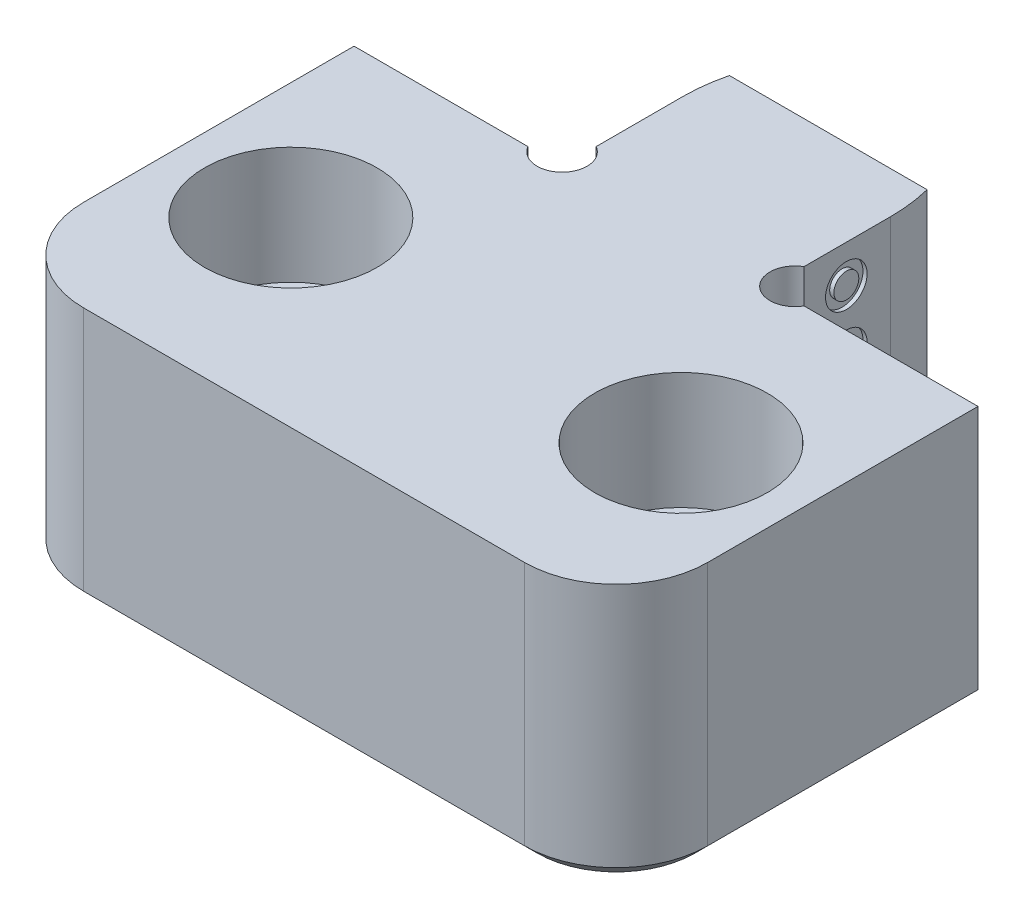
ISO-10303-21;
HEADER;
FILE_DESCRIPTION(('STEP AP214'),'2;1');
FILE_NAME('part.step','',(''),(''),'','','');
FILE_SCHEMA(('AUTOMOTIVE_DESIGN { 1 0 10303 214 1 1 1 1 }'));
ENDSEC;
DATA;
#1=APPLICATION_CONTEXT('core data for automotive mechanical design processes');
#2=APPLICATION_PROTOCOL_DEFINITION('international standard','automotive_design',2000,#1);
#3=PRODUCT_CONTEXT('',#1,'mechanical');
#4=PRODUCT('Part','Part','',(#3));
#5=PRODUCT_RELATED_PRODUCT_CATEGORY('part','',(#4));
#6=PRODUCT_DEFINITION_FORMATION('','',#4);
#7=PRODUCT_DEFINITION_CONTEXT('part definition',#1,'design');
#8=PRODUCT_DEFINITION('design','',#6,#7);
#9=PRODUCT_DEFINITION_SHAPE('','',#8);
#10=(LENGTH_UNIT() NAMED_UNIT(*) SI_UNIT(.MILLI.,.METRE.));
#11=(NAMED_UNIT(*) PLANE_ANGLE_UNIT() SI_UNIT($,.RADIAN.));
#12=(NAMED_UNIT(*) SI_UNIT($,.STERADIAN.) SOLID_ANGLE_UNIT());
#13=UNCERTAINTY_MEASURE_WITH_UNIT(LENGTH_MEASURE(1.E-05),#10,'distance_accuracy_value','');
#14=(GEOMETRIC_REPRESENTATION_CONTEXT(3) GLOBAL_UNCERTAINTY_ASSIGNED_CONTEXT((#13)) GLOBAL_UNIT_ASSIGNED_CONTEXT((#10,
#11,#12)) REPRESENTATION_CONTEXT('',''));
#15=CARTESIAN_POINT('',(0.,0.,0.));
#16=DIRECTION('',(0.,0.,1.));
#17=DIRECTION('',(1.,0.,0.));
#18=AXIS2_PLACEMENT_3D('',#15,#16,#17);
#19=CARTESIAN_POINT('',(-6.34746,-15.748,0.));
#20=DIRECTION('',(-1.,0.,0.));
#21=DIRECTION('',(0.,0.,1.));
#22=AXIS2_PLACEMENT_3D('',#19,#20,#21);
#23=PLANE('',#22);
#24=CARTESIAN_POINT('',(-6.34746,48.006,-2.286));
#25=DIRECTION('',(-1.,0.,0.));
#26=DIRECTION('',(0.,0.,1.));
#27=AXIS2_PLACEMENT_3D('',#24,#25,#26);
#28=CIRCLE('',#27,63.5);
#29=CARTESIAN_POINT('',(-6.34746,-15.494,-2.286));
#30=VERTEX_POINT('',#29);
#31=CARTESIAN_POINT('',(-6.34746,-15.2904738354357,-7.366));
#32=VERTEX_POINT('',#31);
#33=EDGE_CURVE('E189',#30,#32,#28,.F.);
#34=ORIENTED_EDGE('',*,*,#33,.F.);
#35=DIRECTION('',(0.,0.,-1.));
#36=VECTOR('',#35,1.);
#37=CARTESIAN_POINT('',(-6.34746,-15.494,0.));
#38=LINE('',#37,#36);
#39=CARTESIAN_POINT('',(-6.34746,-15.494,-2.08182271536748));
#40=VERTEX_POINT('',#39);
#41=EDGE_CURVE('E173',#40,#30,#38,.T.);
#42=ORIENTED_EDGE('',*,*,#41,.F.);
#43=DIRECTION('',(0.,1.,0.));
#44=VECTOR('',#43,1.);
#45=CARTESIAN_POINT('',(-6.34746,-15.748,-2.08182271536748));
#46=LINE('',#45,#44);
#47=CARTESIAN_POINT('',(-6.34746,0.,-2.08182271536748));
#48=VERTEX_POINT('',#47);
#49=EDGE_CURVE('E324',#48,#40,#46,.F.);
#50=ORIENTED_EDGE('',*,*,#49,.F.);
#51=DIRECTION('',(0.,0.,1.));
#52=VECTOR('',#51,1.);
#53=CARTESIAN_POINT('',(-6.34746,0.,0.));
#54=LINE('',#53,#52);
#55=CARTESIAN_POINT('',(-6.34746,0.,-7.366));
#56=VERTEX_POINT('',#55);
#57=EDGE_CURVE('E283',#56,#48,#54,.T.);
#58=ORIENTED_EDGE('',*,*,#57,.F.);
#59=DIRECTION('',(0.,1.,0.));
#60=VECTOR('',#59,1.);
#61=CARTESIAN_POINT('',(-6.34746,-15.748,-7.366));
#62=LINE('',#61,#60);
#63=EDGE_CURVE('E197',#32,#56,#62,.T.);
#64=ORIENTED_EDGE('',*,*,#63,.F.);
#65=EDGE_LOOP('',(#34,#42,#50,#58,#64));
#66=FACE_BOUND('',#65,.T.);
#67=CARTESIAN_POINT('',(-6.34746,-2.2921183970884,-4.66202288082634));
#68=DIRECTION('',(1.,0.,0.));
#69=DIRECTION('',(0.,0.,-1.));
#70=AXIS2_PLACEMENT_3D('',#67,#68,#69);
#71=CIRCLE('',#70,1.27);
#72=CARTESIAN_POINT('',(-6.34746,-2.2921183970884,-5.93202288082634));
#73=VERTEX_POINT('',#72);
#74=EDGE_CURVE('E546',#73,#73,#71,.T.);
#75=ORIENTED_EDGE('',*,*,#74,.T.);
#76=EDGE_LOOP('',(#75));
#77=FACE_BOUND('',#76,.T.);
#78=CARTESIAN_POINT('',(-6.34746,-5.91540708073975,-4.66202288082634));
#79=DIRECTION('',(1.,0.,0.));
#80=DIRECTION('',(0.,0.,-1.));
#81=AXIS2_PLACEMENT_3D('',#78,#79,#80);
#82=CIRCLE('',#81,1.27);
#83=CARTESIAN_POINT('',(-6.34746,-5.91540708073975,-5.93202288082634));
#84=VERTEX_POINT('',#83);
#85=EDGE_CURVE('E534',#84,#84,#82,.T.);
#86=ORIENTED_EDGE('',*,*,#85,.T.);
#87=EDGE_LOOP('',(#86));
#88=FACE_BOUND('',#87,.T.);
#89=CARTESIAN_POINT('',(-6.34746,-12.7254436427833,-4.66202288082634));
#90=DIRECTION('',(1.,0.,0.));
#91=DIRECTION('',(0.,0.,-1.));
#92=AXIS2_PLACEMENT_3D('',#89,#90,#91);
#93=CIRCLE('',#92,1.27);
#94=CARTESIAN_POINT('',(-6.34746,-12.7254436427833,-5.93202288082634));
#95=VERTEX_POINT('',#94);
#96=EDGE_CURVE('E522',#95,#95,#93,.T.);
#97=ORIENTED_EDGE('',*,*,#96,.T.);
#98=EDGE_LOOP('',(#97));
#99=FACE_BOUND('',#98,.T.);
#100=CARTESIAN_POINT('',(-6.34746,-9.49504168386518,-4.66202288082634));
#101=DIRECTION('',(1.,0.,0.));
#102=DIRECTION('',(0.,0.,-1.));
#103=AXIS2_PLACEMENT_3D('',#100,#101,#102);
#104=CIRCLE('',#103,1.27);
#105=CARTESIAN_POINT('',(-6.34746,-9.49504168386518,-5.93202288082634));
#106=VERTEX_POINT('',#105);
#107=EDGE_CURVE('E510',#106,#106,#104,.T.);
#108=ORIENTED_EDGE('',*,*,#107,.T.);
#109=EDGE_LOOP('',(#108));
#110=FACE_BOUND('',#109,.T.);
#111=ADVANCED_FACE('F34',(#66,#77,#88,#99,#110),#23,.T.);
#112=CARTESIAN_POINT('',(4.15036,0.,-7.366));
#113=DIRECTION('',(0.,-1.,0.));
#114=DIRECTION('',(0.,0.,-1.));
#115=AXIS2_PLACEMENT_3D('',#112,#113,#114);
#116=PLANE('',#115);
#117=CARTESIAN_POINT('',(-11.9126,0.,10.9982));
#118=DIRECTION('',(0.,1.,0.));
#119=DIRECTION('',(0.,0.,1.));
#120=AXIS2_PLACEMENT_3D('',#117,#118,#119);
#121=CIRCLE('',#120,5.2705);
#122=CARTESIAN_POINT('',(-11.9126,0.,16.2687));
#123=VERTEX_POINT('',#122);
#124=EDGE_CURVE('E600',#123,#123,#121,.T.);
#125=ORIENTED_EDGE('',*,*,#124,.F.);
#126=EDGE_LOOP('',(#125));
#127=FACE_BOUND('',#126,.T.);
#128=DIRECTION('',(0.,0.,1.));
#129=VECTOR('',#128,1.);
#130=CARTESIAN_POINT('',(-19.05,0.,0.));
#131=LINE('',#130,#129);
#132=CARTESIAN_POINT('',(-19.05,0.,0.));
#133=VERTEX_POINT('',#132);
#134=CARTESIAN_POINT('',(-19.05,0.,16.51));
#135=VERTEX_POINT('',#134);
#136=EDGE_CURVE('E290',#133,#135,#131,.T.);
#137=ORIENTED_EDGE('',*,*,#136,.T.);
#138=CARTESIAN_POINT('',(-13.462,0.,16.51));
#139=DIRECTION('',(0.,-1.,0.));
#140=DIRECTION('',(0.,0.,-1.));
#141=AXIS2_PLACEMENT_3D('',#138,#139,#140);
#142=CIRCLE('',#141,5.588);
#143=CARTESIAN_POINT('',(-13.462,0.,22.098));
#144=VERTEX_POINT('',#143);
#145=EDGE_CURVE('E208',#135,#144,#142,.F.);
#146=ORIENTED_EDGE('',*,*,#145,.T.);
#147=DIRECTION('',(1.,0.,0.));
#148=VECTOR('',#147,1.);
#149=CARTESIAN_POINT('',(-19.05,0.,22.098));
#150=LINE('',#149,#148);
#151=CARTESIAN_POINT('',(13.462,0.,22.098));
#152=VERTEX_POINT('',#151);
#153=EDGE_CURVE('E293',#144,#152,#150,.T.);
#154=ORIENTED_EDGE('',*,*,#153,.T.);
#155=CARTESIAN_POINT('',(13.462,0.,16.51));
#156=DIRECTION('',(0.,-1.,0.));
#157=DIRECTION('',(0.,0.,-1.));
#158=AXIS2_PLACEMENT_3D('',#155,#156,#157);
#159=CIRCLE('',#158,5.588);
#160=CARTESIAN_POINT('',(19.05,0.,16.51));
#161=VERTEX_POINT('',#160);
#162=EDGE_CURVE('E201',#152,#161,#159,.F.);
#163=ORIENTED_EDGE('',*,*,#162,.T.);
#164=DIRECTION('',(0.,0.,-1.));
#165=VECTOR('',#164,1.);
#166=CARTESIAN_POINT('',(19.05,0.,0.));
#167=LINE('',#166,#165);
#168=CARTESIAN_POINT('',(19.05,0.,0.));
#169=VERTEX_POINT('',#168);
#170=EDGE_CURVE('E296',#161,#169,#167,.T.);
#171=ORIENTED_EDGE('',*,*,#170,.T.);
#172=DIRECTION('',(-1.,0.,0.));
#173=VECTOR('',#172,1.);
#174=CARTESIAN_POINT('',(6.34746,0.,0.));
#175=LINE('',#174,#173);
#176=CARTESIAN_POINT('',(8.42928271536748,0.,0.));
#177=VERTEX_POINT('',#176);
#178=EDGE_CURVE('E299',#169,#177,#175,.T.);
#179=ORIENTED_EDGE('',*,*,#178,.T.);
#180=CARTESIAN_POINT('',(7.10946,0.,-0.761999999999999));
#181=DIRECTION('',(0.,-1.,0.));
#182=DIRECTION('',(0.,0.,-1.));
#183=AXIS2_PLACEMENT_3D('',#180,#181,#182);
#184=CIRCLE('',#183,1.524);
#185=CARTESIAN_POINT('',(6.34746,0.,-2.08182271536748));
#186=VERTEX_POINT('',#185);
#187=EDGE_CURVE('E312',#177,#186,#184,.T.);
#188=ORIENTED_EDGE('',*,*,#187,.T.);
#189=DIRECTION('',(0.,0.,-1.));
#190=VECTOR('',#189,1.);
#191=CARTESIAN_POINT('',(6.34746,0.,-7.366));
#192=LINE('',#191,#190);
#193=CARTESIAN_POINT('',(6.34746,0.,-7.366));
#194=VERTEX_POINT('',#193);
#195=EDGE_CURVE('E302',#186,#194,#192,.T.);
#196=ORIENTED_EDGE('',*,*,#195,.T.);
#197=CARTESIAN_POINT('',(-4.15036,0.,-7.366));
#198=DIRECTION('',(0.,1.,0.));
#199=DIRECTION('',(0.,0.,1.));
#200=AXIS2_PLACEMENT_3D('',#197,#198,#199);
#201=CIRCLE('',#200,10.49782);
#202=CARTESIAN_POINT('',(6.03554323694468,0.,-9.906));
#203=VERTEX_POINT('',#202);
#204=EDGE_CURVE('E305',#194,#203,#201,.T.);
#205=ORIENTED_EDGE('',*,*,#204,.T.);
#206=DIRECTION('',(-1.,0.,0.));
#207=VECTOR('',#206,1.);
#208=CARTESIAN_POINT('',(-6.03554323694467,0.,-9.906));
#209=LINE('',#208,#207);
#210=CARTESIAN_POINT('',(-6.03554323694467,0.,-9.906));
#211=VERTEX_POINT('',#210);
#212=EDGE_CURVE('E276',#203,#211,#209,.T.);
#213=ORIENTED_EDGE('',*,*,#212,.T.);
#214=CARTESIAN_POINT('',(4.15036,0.,-7.366));
#215=DIRECTION('',(0.,1.,0.));
#216=DIRECTION('',(0.,0.,-1.));
#217=AXIS2_PLACEMENT_3D('',#214,#215,#216);
#218=CIRCLE('',#217,10.49782);
#219=EDGE_CURVE('E280',#211,#56,#218,.T.);
#220=ORIENTED_EDGE('',*,*,#219,.T.);
#221=ORIENTED_EDGE('',*,*,#57,.T.);
#222=CARTESIAN_POINT('',(-7.10946,0.,-0.761999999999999));
#223=DIRECTION('',(0.,1.,0.));
#224=DIRECTION('',(0.,0.,-1.));
#225=AXIS2_PLACEMENT_3D('',#222,#223,#224);
#226=CIRCLE('',#225,1.524);
#227=CARTESIAN_POINT('',(-8.42928271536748,0.,0.));
#228=VERTEX_POINT('',#227);
#229=EDGE_CURVE('E326',#228,#48,#226,.T.);
#230=ORIENTED_EDGE('',*,*,#229,.F.);
#231=DIRECTION('',(-1.,0.,0.));
#232=VECTOR('',#231,1.);
#233=CARTESIAN_POINT('',(-6.34746,0.,0.));
#234=LINE('',#233,#232);
#235=EDGE_CURVE('E287',#228,#133,#234,.T.);
#236=ORIENTED_EDGE('',*,*,#235,.T.);
#237=EDGE_LOOP('',(#137,#146,#154,#163,#171,#179,#188,#196,#205,#213,#220,#221,#230,#236));
#238=FACE_BOUND('',#237,.T.);
#239=CARTESIAN_POINT('',(11.9126,0.,10.9982));
#240=DIRECTION('',(0.,1.,0.));
#241=DIRECTION('',(0.,0.,1.));
#242=AXIS2_PLACEMENT_3D('',#239,#240,#241);
#243=CIRCLE('',#242,5.2705);
#244=CARTESIAN_POINT('',(11.9126,0.,16.2687));
#245=VERTEX_POINT('',#244);
#246=EDGE_CURVE('E614',#245,#245,#243,.T.);
#247=ORIENTED_EDGE('',*,*,#246,.F.);
#248=EDGE_LOOP('',(#247));
#249=FACE_BOUND('',#248,.T.);
#250=ADVANCED_FACE('F344',(#127,#238,#249),#116,.F.);
#251=CARTESIAN_POINT('',(4.15036,-15.748,-7.366));
#252=DIRECTION('',(0.,1.,0.));
#253=DIRECTION('',(0.,0.,1.));
#254=AXIS2_PLACEMENT_3D('',#251,#252,#253);
#255=CYLINDRICAL_SURFACE('',#254,10.49782);
#256=CARTESIAN_POINT('',(-6.34746,-15.2904738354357,-7.366));
#257=CARTESIAN_POINT('',(-6.34746862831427,-15.2732580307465,-7.58057545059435));
#258=CARTESIAN_POINT('',(-6.3408811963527,-15.2549406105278,-7.79505896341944));
#259=CARTESIAN_POINT('',(-6.31466135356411,-15.2162813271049,-8.22222697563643));
#260=CARTESIAN_POINT('',(-6.29507815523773,-15.195947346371,-8.43491520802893));
#261=CARTESIAN_POINT('',(-6.24301249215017,-15.1533025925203,-8.85850428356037));
#262=CARTESIAN_POINT('',(-6.21053010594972,-15.1309918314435,-9.0694051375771));
#263=CARTESIAN_POINT('',(-6.1326878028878,-15.0844545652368,-9.48943789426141));
#264=CARTESIAN_POINT('',(-6.08727967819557,-15.0602211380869,-9.69856009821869));
#265=CARTESIAN_POINT('',(-6.03554323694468,-15.0351421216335,-9.906));
#266=B_SPLINE_CURVE_WITH_KNOTS('',3,(#256,#257,#258,#259,#260,#261,#262,#263,#264,#265),
.UNSPECIFIED.,.F.,.F.,(4,2,2,2,4),(0.,0.645686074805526,1.28894090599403,1.93219181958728,
2.57787396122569),.UNSPECIFIED.);
#267=CARTESIAN_POINT('',(-6.03554323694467,-15.0351421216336,-9.906));
#268=VERTEX_POINT('',#267);
#269=EDGE_CURVE('E398',#32,#268,#266,.T.);
#270=ORIENTED_EDGE('',*,*,#269,.F.);
#271=ORIENTED_EDGE('',*,*,#63,.T.);
#272=ORIENTED_EDGE('',*,*,#219,.F.);
#273=DIRECTION('',(0.,1.,0.));
#274=VECTOR('',#273,1.);
#275=CARTESIAN_POINT('',(-6.03554323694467,-15.748,-9.906));
#276=LINE('',#275,#274);
#277=EDGE_CURVE('E310',#268,#211,#276,.T.);
#278=ORIENTED_EDGE('',*,*,#277,.F.);
#279=EDGE_LOOP('',(#270,#271,#272,#278));
#280=FACE_BOUND('',#279,.T.);
#281=ADVANCED_FACE('F362',(#280),#255,.T.);
#282=CARTESIAN_POINT('',(-6.03554323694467,-15.748,-9.906));
#283=DIRECTION('',(0.,0.,-1.));
#284=DIRECTION('',(-1.,0.,0.));
#285=AXIS2_PLACEMENT_3D('',#282,#283,#284);
#286=PLANE('',#285);
#287=DIRECTION('',(1.,0.,0.));
#288=VECTOR('',#287,1.);
#289=CARTESIAN_POINT('',(-19.05,-15.0351421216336,-9.906));
#290=LINE('',#289,#288);
#291=CARTESIAN_POINT('',(6.03554323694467,-15.0351421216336,-9.906));
#292=VERTEX_POINT('',#291);
#293=EDGE_CURVE('E360',#268,#292,#290,.T.);
#294=ORIENTED_EDGE('',*,*,#293,.F.);
#295=ORIENTED_EDGE('',*,*,#277,.T.);
#296=ORIENTED_EDGE('',*,*,#212,.F.);
#297=DIRECTION('',(0.,1.,0.));
#298=VECTOR('',#297,1.);
#299=CARTESIAN_POINT('',(6.03554323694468,-15.748,-9.906));
#300=LINE('',#299,#298);
#301=EDGE_CURVE('E313',#292,#203,#300,.T.);
#302=ORIENTED_EDGE('',*,*,#301,.F.);
#303=EDGE_LOOP('',(#294,#295,#296,#302));
#304=FACE_BOUND('',#303,.T.);
#305=ADVANCED_FACE('F357',(#304),#286,.T.);
#306=CARTESIAN_POINT('',(-4.15036,-15.748,-7.366));
#307=DIRECTION('',(0.,1.,0.));
#308=DIRECTION('',(0.,0.,1.));
#309=AXIS2_PLACEMENT_3D('',#306,#307,#308);
#310=CYLINDRICAL_SURFACE('',#309,10.49782);
#311=CARTESIAN_POINT('',(6.03554323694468,-15.0351421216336,-9.906));
#312=CARTESIAN_POINT('',(6.08727967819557,-15.0602211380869,-9.69856009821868));
#313=CARTESIAN_POINT('',(6.1326878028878,-15.0844545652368,-9.48943789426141));
#314=CARTESIAN_POINT('',(6.21053010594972,-15.1309918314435,-9.0694051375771));
#315=CARTESIAN_POINT('',(6.24301249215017,-15.1533025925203,-8.85850428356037));
#316=CARTESIAN_POINT('',(6.29507815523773,-15.195947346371,-8.43491520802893));
#317=CARTESIAN_POINT('',(6.31466135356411,-15.2162813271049,-8.22222697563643));
#318=CARTESIAN_POINT('',(6.3408811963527,-15.2549406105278,-7.79505896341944));
#319=CARTESIAN_POINT('',(6.34746862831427,-15.2732580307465,-7.58057545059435));
#320=CARTESIAN_POINT('',(6.34746,-15.2904738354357,-7.366));
#321=B_SPLINE_CURVE_WITH_KNOTS('',3,(#311,#312,#313,#314,#315,#316,#317,#318,#319,#320),
.UNSPECIFIED.,.F.,.F.,(4,2,2,2,4),(0.,0.64568214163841,1.28893305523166,1.93218788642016,
2.57787396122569),.UNSPECIFIED.);
#322=CARTESIAN_POINT('',(6.34746,-15.2904738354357,-7.366));
#323=VERTEX_POINT('',#322);
#324=EDGE_CURVE('E352',#292,#323,#321,.T.);
#325=ORIENTED_EDGE('',*,*,#324,.F.);
#326=ORIENTED_EDGE('',*,*,#301,.T.);
#327=ORIENTED_EDGE('',*,*,#204,.F.);
#328=DIRECTION('',(0.,1.,0.));
#329=VECTOR('',#328,1.);
#330=CARTESIAN_POINT('',(6.34746,-15.748,-7.366));
#331=LINE('',#330,#329);
#332=EDGE_CURVE('E315',#323,#194,#331,.T.);
#333=ORIENTED_EDGE('',*,*,#332,.F.);
#334=EDGE_LOOP('',(#325,#326,#327,#333));
#335=FACE_BOUND('',#334,.T.);
#336=ADVANCED_FACE('F351',(#335),#310,.T.);
#337=CARTESIAN_POINT('',(6.34746,-15.748,-7.366));
#338=DIRECTION('',(1.,0.,0.));
#339=DIRECTION('',(0.,0.,-1.));
#340=AXIS2_PLACEMENT_3D('',#337,#338,#339);
#341=PLANE('',#340);
#342=CARTESIAN_POINT('',(6.34746,-9.49504168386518,-4.66202288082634));
#343=DIRECTION('',(1.,0.,0.));
#344=DIRECTION('',(0.,0.,-1.));
#345=AXIS2_PLACEMENT_3D('',#342,#343,#344);
#346=CIRCLE('',#345,1.27);
#347=CARTESIAN_POINT('',(6.34746,-9.49504168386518,-5.93202288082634));
#348=VERTEX_POINT('',#347);
#349=EDGE_CURVE('E558',#348,#348,#346,.T.);
#350=ORIENTED_EDGE('',*,*,#349,.F.);
#351=EDGE_LOOP('',(#350));
#352=FACE_BOUND('',#351,.T.);
#353=CARTESIAN_POINT('',(6.34746,-12.7254436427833,-4.66202288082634));
#354=DIRECTION('',(1.,0.,0.));
#355=DIRECTION('',(0.,0.,-1.));
#356=AXIS2_PLACEMENT_3D('',#353,#354,#355);
#357=CIRCLE('',#356,1.27);
#358=CARTESIAN_POINT('',(6.34746,-12.7254436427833,-5.93202288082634));
#359=VERTEX_POINT('',#358);
#360=EDGE_CURVE('E570',#359,#359,#357,.T.);
#361=ORIENTED_EDGE('',*,*,#360,.F.);
#362=EDGE_LOOP('',(#361));
#363=FACE_BOUND('',#362,.T.);
#364=CARTESIAN_POINT('',(6.34746,-5.91540708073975,-4.66202288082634));
#365=DIRECTION('',(1.,0.,0.));
#366=DIRECTION('',(0.,0.,-1.));
#367=AXIS2_PLACEMENT_3D('',#364,#365,#366);
#368=CIRCLE('',#367,1.27);
#369=CARTESIAN_POINT('',(6.34746,-5.91540708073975,-5.93202288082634));
#370=VERTEX_POINT('',#369);
#371=EDGE_CURVE('E582',#370,#370,#368,.T.);
#372=ORIENTED_EDGE('',*,*,#371,.F.);
#373=EDGE_LOOP('',(#372));
#374=FACE_BOUND('',#373,.T.);
#375=CARTESIAN_POINT('',(6.34746,-2.2921183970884,-4.66202288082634));
#376=DIRECTION('',(1.,0.,0.));
#377=DIRECTION('',(0.,0.,-1.));
#378=AXIS2_PLACEMENT_3D('',#375,#376,#377);
#379=CIRCLE('',#378,1.27);
#380=CARTESIAN_POINT('',(6.34746,-2.2921183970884,-5.93202288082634));
#381=VERTEX_POINT('',#380);
#382=EDGE_CURVE('E594',#381,#381,#379,.T.);
#383=ORIENTED_EDGE('',*,*,#382,.F.);
#384=EDGE_LOOP('',(#383));
#385=FACE_BOUND('',#384,.T.);
#386=CARTESIAN_POINT('',(6.34746,48.006,-2.286));
#387=DIRECTION('',(1.,0.,0.));
#388=DIRECTION('',(0.,0.,-1.));
#389=AXIS2_PLACEMENT_3D('',#386,#387,#388);
#390=CIRCLE('',#389,63.5);
#391=CARTESIAN_POINT('',(6.34746,-15.494,-2.286));
#392=VERTEX_POINT('',#391);
#393=EDGE_CURVE('E192',#323,#392,#390,.F.);
#394=ORIENTED_EDGE('',*,*,#393,.F.);
#395=ORIENTED_EDGE('',*,*,#332,.T.);
#396=ORIENTED_EDGE('',*,*,#195,.F.);
#397=DIRECTION('',(0.,1.,0.));
#398=VECTOR('',#397,1.);
#399=CARTESIAN_POINT('',(6.34746,-15.748,-2.08182271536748));
#400=LINE('',#399,#398);
#401=CARTESIAN_POINT('',(6.34746,-15.494,-2.08182271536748));
#402=VERTEX_POINT('',#401);
#403=EDGE_CURVE('E284',#402,#186,#400,.T.);
#404=ORIENTED_EDGE('',*,*,#403,.F.);
#405=DIRECTION('',(0.,0.,1.));
#406=VECTOR('',#405,1.);
#407=CARTESIAN_POINT('',(6.34746,-15.494,-7.366));
#408=LINE('',#407,#406);
#409=EDGE_CURVE('E395',#392,#402,#408,.T.);
#410=ORIENTED_EDGE('',*,*,#409,.F.);
#411=EDGE_LOOP('',(#394,#395,#396,#404,#410));
#412=FACE_BOUND('',#411,.T.);
#413=ADVANCED_FACE('F347',(#352,#363,#374,#385,#412),#341,.T.);
#414=CARTESIAN_POINT('',(6.34746,-15.748,0.));
#415=DIRECTION('',(0.,0.,-1.));
#416=DIRECTION('',(-1.,0.,0.));
#417=AXIS2_PLACEMENT_3D('',#414,#415,#416);
#418=PLANE('',#417);
#419=DIRECTION('',(0.,1.,0.));
#420=VECTOR('',#419,1.);
#421=CARTESIAN_POINT('',(19.05,-15.748,0.));
#422=LINE('',#421,#420);
#423=CARTESIAN_POINT('',(19.05,-14.986,0.));
#424=VERTEX_POINT('',#423);
#425=EDGE_CURVE('E264',#424,#169,#422,.T.);
#426=ORIENTED_EDGE('',*,*,#425,.F.);
#427=DIRECTION('',(0.707106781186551,0.707106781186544,0.));
#428=VECTOR('',#427,1.);
#429=CARTESIAN_POINT('',(12.3177299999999,-21.71827,0.));
#430=LINE('',#429,#428);
#431=CARTESIAN_POINT('',(18.288,-15.748,0.));
#432=VERTEX_POINT('',#431);
#433=EDGE_CURVE('E11',#424,#432,#430,.F.);
#434=ORIENTED_EDGE('',*,*,#433,.T.);
#435=DIRECTION('',(-1.,0.,0.));
#436=VECTOR('',#435,1.);
#437=CARTESIAN_POINT('',(6.34746,-15.748,0.));
#438=LINE('',#437,#436);
#439=CARTESIAN_POINT('',(8.42928271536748,-15.748,0.));
#440=VERTEX_POINT('',#439);
#441=EDGE_CURVE('E261',#432,#440,#438,.T.);
#442=ORIENTED_EDGE('',*,*,#441,.T.);
#443=DIRECTION('',(0.,1.,0.));
#444=VECTOR('',#443,1.);
#445=CARTESIAN_POINT('',(8.42928271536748,-15.748,0.));
#446=LINE('',#445,#444);
#447=EDGE_CURVE('E335',#177,#440,#446,.F.);
#448=ORIENTED_EDGE('',*,*,#447,.F.);
#449=ORIENTED_EDGE('',*,*,#178,.F.);
#450=EDGE_LOOP('',(#426,#434,#442,#448,#449));
#451=FACE_BOUND('',#450,.T.);
#452=ADVANCED_FACE('F259',(#451),#418,.T.);
#453=CARTESIAN_POINT('',(19.05,-15.748,0.));
#454=DIRECTION('',(1.,0.,0.));
#455=DIRECTION('',(0.,0.,-1.));
#456=AXIS2_PLACEMENT_3D('',#453,#454,#455);
#457=PLANE('',#456);
#458=DIRECTION('',(0.,1.,0.));
#459=VECTOR('',#458,1.);
#460=CARTESIAN_POINT('',(19.05,-15.748,16.51));
#461=LINE('',#460,#459);
#462=CARTESIAN_POINT('',(19.05,-14.986,16.51));
#463=VERTEX_POINT('',#462);
#464=EDGE_CURVE('E215',#161,#463,#461,.F.);
#465=ORIENTED_EDGE('',*,*,#464,.T.);
#466=DIRECTION('',(0.,0.,-1.));
#467=VECTOR('',#466,1.);
#468=CARTESIAN_POINT('',(19.05,-14.986,0.));
#469=LINE('',#468,#467);
#470=EDGE_CURVE('E43',#463,#424,#469,.T.);
#471=ORIENTED_EDGE('',*,*,#470,.T.);
#472=ORIENTED_EDGE('',*,*,#425,.T.);
#473=ORIENTED_EDGE('',*,*,#170,.F.);
#474=EDGE_LOOP('',(#465,#471,#472,#473));
#475=FACE_BOUND('',#474,.T.);
#476=ADVANCED_FACE('F439',(#475),#457,.T.);
#477=CARTESIAN_POINT('',(-19.05,-15.748,22.098));
#478=DIRECTION('',(0.,0.,1.));
#479=DIRECTION('',(1.,0.,0.));
#480=AXIS2_PLACEMENT_3D('',#477,#478,#479);
#481=PLANE('',#480);
#482=DIRECTION('',(0.,1.,0.));
#483=VECTOR('',#482,1.);
#484=CARTESIAN_POINT('',(-13.462,-15.748,22.098));
#485=LINE('',#484,#483);
#486=CARTESIAN_POINT('',(-13.462,-14.986,22.098));
#487=VERTEX_POINT('',#486);
#488=EDGE_CURVE('E212',#144,#487,#485,.F.);
#489=ORIENTED_EDGE('',*,*,#488,.T.);
#490=DIRECTION('',(1.,0.,0.));
#491=VECTOR('',#490,1.);
#492=CARTESIAN_POINT('',(-19.05,-14.986,22.098));
#493=LINE('',#492,#491);
#494=CARTESIAN_POINT('',(13.462,-14.986,22.098));
#495=VERTEX_POINT('',#494);
#496=EDGE_CURVE('E234',#487,#495,#493,.T.);
#497=ORIENTED_EDGE('',*,*,#496,.T.);
#498=DIRECTION('',(0.,1.,0.));
#499=VECTOR('',#498,1.);
#500=CARTESIAN_POINT('',(13.462,-15.748,22.098));
#501=LINE('',#500,#499);
#502=EDGE_CURVE('E210',#495,#152,#501,.T.);
#503=ORIENTED_EDGE('',*,*,#502,.T.);
#504=ORIENTED_EDGE('',*,*,#153,.F.);
#505=EDGE_LOOP('',(#489,#497,#503,#504));
#506=FACE_BOUND('',#505,.T.);
#507=ADVANCED_FACE('F390',(#506),#481,.T.);
#508=CARTESIAN_POINT('',(-19.05,-15.748,0.));
#509=DIRECTION('',(-1.,0.,0.));
#510=DIRECTION('',(0.,0.,1.));
#511=AXIS2_PLACEMENT_3D('',#508,#509,#510);
#512=PLANE('',#511);
#513=DIRECTION('',(0.,1.,0.));
#514=VECTOR('',#513,1.);
#515=CARTESIAN_POINT('',(-19.05,-15.748,0.));
#516=LINE('',#515,#514);
#517=CARTESIAN_POINT('',(-19.05,-14.986,0.));
#518=VERTEX_POINT('',#517);
#519=EDGE_CURVE('E273',#518,#133,#516,.T.);
#520=ORIENTED_EDGE('',*,*,#519,.F.);
#521=DIRECTION('',(0.,0.,1.));
#522=VECTOR('',#521,1.);
#523=CARTESIAN_POINT('',(-19.05,-14.986,0.));
#524=LINE('',#523,#522);
#525=CARTESIAN_POINT('',(-19.05,-14.986,16.51));
#526=VERTEX_POINT('',#525);
#527=EDGE_CURVE('E217',#518,#526,#524,.T.);
#528=ORIENTED_EDGE('',*,*,#527,.T.);
#529=DIRECTION('',(0.,1.,0.));
#530=VECTOR('',#529,1.);
#531=CARTESIAN_POINT('',(-19.05,-15.748,16.51));
#532=LINE('',#531,#530);
#533=EDGE_CURVE('E198',#526,#135,#532,.T.);
#534=ORIENTED_EDGE('',*,*,#533,.T.);
#535=ORIENTED_EDGE('',*,*,#136,.F.);
#536=EDGE_LOOP('',(#520,#528,#534,#535));
#537=FACE_BOUND('',#536,.T.);
#538=ADVANCED_FACE('F373',(#537),#512,.T.);
#539=CARTESIAN_POINT('',(-6.34746,-15.748,0.));
#540=DIRECTION('',(0.,0.,-1.));
#541=DIRECTION('',(-1.,0.,0.));
#542=AXIS2_PLACEMENT_3D('',#539,#540,#541);
#543=PLANE('',#542);
#544=DIRECTION('',(-1.,0.,0.));
#545=VECTOR('',#544,1.);
#546=CARTESIAN_POINT('',(-6.34746,-15.748,0.));
#547=LINE('',#546,#545);
#548=CARTESIAN_POINT('',(-8.42928271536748,-15.748,0.));
#549=VERTEX_POINT('',#548);
#550=CARTESIAN_POINT('',(-18.288,-15.748,0.));
#551=VERTEX_POINT('',#550);
#552=EDGE_CURVE('E271',#549,#551,#547,.T.);
#553=ORIENTED_EDGE('',*,*,#552,.T.);
#554=DIRECTION('',(0.707106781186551,-0.707106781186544,0.));
#555=VECTOR('',#554,1.);
#556=CARTESIAN_POINT('',(-12.3177299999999,-21.71827,0.));
#557=LINE('',#556,#555);
#558=EDGE_CURVE('E230',#551,#518,#557,.F.);
#559=ORIENTED_EDGE('',*,*,#558,.T.);
#560=ORIENTED_EDGE('',*,*,#519,.T.);
#561=ORIENTED_EDGE('',*,*,#235,.F.);
#562=DIRECTION('',(0.,1.,0.));
#563=VECTOR('',#562,1.);
#564=CARTESIAN_POINT('',(-8.42928271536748,-15.748,0.));
#565=LINE('',#564,#563);
#566=EDGE_CURVE('E327',#549,#228,#565,.T.);
#567=ORIENTED_EDGE('',*,*,#566,.F.);
#568=EDGE_LOOP('',(#553,#559,#560,#561,#567));
#569=FACE_BOUND('',#568,.T.);
#570=ADVANCED_FACE('F367',(#569),#543,.T.);
#571=CARTESIAN_POINT('',(4.15036,-15.748,-7.366));
#572=DIRECTION('',(0.,-1.,0.));
#573=DIRECTION('',(0.,0.,-1.));
#574=AXIS2_PLACEMENT_3D('',#571,#572,#573);
#575=PLANE('',#574);
#576=CARTESIAN_POINT('',(-11.9126,-15.748,10.9982));
#577=DIRECTION('',(0.,1.,0.));
#578=DIRECTION('',(0.,0.,1.));
#579=AXIS2_PLACEMENT_3D('',#576,#577,#578);
#580=CIRCLE('',#579,3.5687);
#581=CARTESIAN_POINT('',(-11.9126,-15.748,14.5669));
#582=VERTEX_POINT('',#581);
#583=EDGE_CURVE('E611',#582,#582,#580,.T.);
#584=ORIENTED_EDGE('',*,*,#583,.T.);
#585=EDGE_LOOP('',(#584));
#586=FACE_BOUND('',#585,.T.);
#587=CARTESIAN_POINT('',(11.9126,-15.748,10.9982));
#588=DIRECTION('',(0.,1.,0.));
#589=DIRECTION('',(0.,0.,1.));
#590=AXIS2_PLACEMENT_3D('',#587,#588,#589);
#591=CIRCLE('',#590,3.5687);
#592=CARTESIAN_POINT('',(11.9126,-15.748,14.5669));
#593=VERTEX_POINT('',#592);
#594=EDGE_CURVE('E241',#593,#593,#591,.T.);
#595=ORIENTED_EDGE('',*,*,#594,.T.);
#596=EDGE_LOOP('',(#595));
#597=FACE_BOUND('',#596,.T.);
#598=CARTESIAN_POINT('',(-13.462,-15.748,16.51));
#599=DIRECTION('',(0.,-1.,0.));
#600=DIRECTION('',(0.,0.,-1.));
#601=AXIS2_PLACEMENT_3D('',#598,#599,#600);
#602=CIRCLE('',#601,4.82599999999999);
#603=CARTESIAN_POINT('',(-13.462,-15.748,21.336));
#604=VERTEX_POINT('',#603);
#605=CARTESIAN_POINT('',(-18.288,-15.748,16.51));
#606=VERTEX_POINT('',#605);
#607=EDGE_CURVE('E226',#604,#606,#602,.T.);
#608=ORIENTED_EDGE('',*,*,#607,.T.);
#609=DIRECTION('',(0.,0.,-1.));
#610=VECTOR('',#609,1.);
#611=CARTESIAN_POINT('',(-18.288,-15.748,-7.366));
#612=LINE('',#611,#610);
#613=EDGE_CURVE('E228',#606,#551,#612,.T.);
#614=ORIENTED_EDGE('',*,*,#613,.T.);
#615=ORIENTED_EDGE('',*,*,#552,.F.);
#616=CARTESIAN_POINT('',(-7.10946,-15.748,-0.761999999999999));
#617=DIRECTION('',(0.,1.,0.));
#618=DIRECTION('',(0.,0.,-1.));
#619=AXIS2_PLACEMENT_3D('',#616,#617,#618);
#620=CIRCLE('',#619,1.524);
#621=CARTESIAN_POINT('',(-5.78963728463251,-15.748,0.));
#622=VERTEX_POINT('',#621);
#623=EDGE_CURVE('E328',#549,#622,#620,.T.);
#624=ORIENTED_EDGE('',*,*,#623,.T.);
#625=DIRECTION('',(-1.,0.,0.));
#626=VECTOR('',#625,1.);
#627=CARTESIAN_POINT('',(4.15036,-15.748,0.));
#628=LINE('',#627,#626);
#629=CARTESIAN_POINT('',(5.78963728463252,-15.748,0.));
#630=VERTEX_POINT('',#629);
#631=EDGE_CURVE('E392',#630,#622,#628,.T.);
#632=ORIENTED_EDGE('',*,*,#631,.F.);
#633=CARTESIAN_POINT('',(7.10946,-15.748,-0.761999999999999));
#634=DIRECTION('',(0.,1.,0.));
#635=DIRECTION('',(0.,0.,1.));
#636=AXIS2_PLACEMENT_3D('',#633,#634,#635);
#637=CIRCLE('',#636,1.524);
#638=EDGE_CURVE('E270',#630,#440,#637,.T.);
#639=ORIENTED_EDGE('',*,*,#638,.T.);
#640=ORIENTED_EDGE('',*,*,#441,.F.);
#641=DIRECTION('',(0.,0.,1.));
#642=VECTOR('',#641,1.);
#643=CARTESIAN_POINT('',(18.288,-15.748,-7.366));
#644=LINE('',#643,#642);
#645=CARTESIAN_POINT('',(18.288,-15.748,16.51));
#646=VERTEX_POINT('',#645);
#647=EDGE_CURVE('E220',#432,#646,#644,.T.);
#648=ORIENTED_EDGE('',*,*,#647,.T.);
#649=CARTESIAN_POINT('',(13.462,-15.748,16.51));
#650=DIRECTION('',(0.,-1.,0.));
#651=DIRECTION('',(0.,0.,-1.));
#652=AXIS2_PLACEMENT_3D('',#649,#650,#651);
#653=CIRCLE('',#652,4.82599999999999);
#654=CARTESIAN_POINT('',(13.462,-15.748,21.336));
#655=VERTEX_POINT('',#654);
#656=EDGE_CURVE('E222',#646,#655,#653,.T.);
#657=ORIENTED_EDGE('',*,*,#656,.T.);
#658=DIRECTION('',(-1.,0.,0.));
#659=VECTOR('',#658,1.);
#660=CARTESIAN_POINT('',(4.15036,-15.748,21.336));
#661=LINE('',#660,#659);
#662=EDGE_CURVE('E224',#655,#604,#661,.T.);
#663=ORIENTED_EDGE('',*,*,#662,.T.);
#664=EDGE_LOOP('',(#608,#614,#615,#624,#632,#639,#640,#648,#657,#663));
#665=FACE_BOUND('',#664,.T.);
#666=ADVANCED_FACE('F267',(#586,#597,#665),#575,.T.);
#667=CARTESIAN_POINT('',(7.10946,-15.748,-0.761999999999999));
#668=DIRECTION('',(0.,1.,0.));
#669=DIRECTION('',(0.,0.,1.));
#670=AXIS2_PLACEMENT_3D('',#667,#668,#669);
#671=CYLINDRICAL_SURFACE('',#670,1.524);
#672=ORIENTED_EDGE('',*,*,#638,.F.);
#673=DIRECTION('',(0.,1.,0.));
#674=VECTOR('',#673,1.);
#675=CARTESIAN_POINT('',(5.78963728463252,-15.748,0.));
#676=LINE('',#675,#674);
#677=CARTESIAN_POINT('',(5.78963728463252,-15.494,0.));
#678=VERTEX_POINT('',#677);
#679=EDGE_CURVE('E394',#630,#678,#676,.T.);
#680=ORIENTED_EDGE('',*,*,#679,.T.);
#681=CARTESIAN_POINT('',(7.10946,-15.494,-0.761999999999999));
#682=DIRECTION('',(0.,1.,0.));
#683=DIRECTION('',(0.,0.,1.));
#684=AXIS2_PLACEMENT_3D('',#681,#682,#683);
#685=CIRCLE('',#684,1.524);
#686=EDGE_CURVE('E184',#678,#402,#685,.F.);
#687=ORIENTED_EDGE('',*,*,#686,.T.);
#688=ORIENTED_EDGE('',*,*,#403,.T.);
#689=ORIENTED_EDGE('',*,*,#187,.F.);
#690=ORIENTED_EDGE('',*,*,#447,.T.);
#691=EDGE_LOOP('',(#672,#680,#687,#688,#689,#690));
#692=FACE_BOUND('',#691,.T.);
#693=ADVANCED_FACE('F339',(#692),#671,.F.);
#694=CARTESIAN_POINT('',(-7.10946,-15.748,-0.761999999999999));
#695=DIRECTION('',(0.,1.,0.));
#696=DIRECTION('',(0.,0.,1.));
#697=AXIS2_PLACEMENT_3D('',#694,#695,#696);
#698=CYLINDRICAL_SURFACE('',#697,1.524);
#699=CARTESIAN_POINT('',(-7.10946,-15.494,-0.761999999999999));
#700=DIRECTION('',(0.,1.,0.));
#701=DIRECTION('',(0.,0.,1.));
#702=AXIS2_PLACEMENT_3D('',#699,#700,#701);
#703=CIRCLE('',#702,1.524);
#704=CARTESIAN_POINT('',(-5.78963728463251,-15.494,0.));
#705=VERTEX_POINT('',#704);
#706=EDGE_CURVE('E179',#40,#705,#703,.F.);
#707=ORIENTED_EDGE('',*,*,#706,.T.);
#708=DIRECTION('',(0.,1.,0.));
#709=VECTOR('',#708,1.);
#710=CARTESIAN_POINT('',(-5.78963728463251,-15.748,0.));
#711=LINE('',#710,#709);
#712=EDGE_CURVE('E199',#705,#622,#711,.F.);
#713=ORIENTED_EDGE('',*,*,#712,.T.);
#714=ORIENTED_EDGE('',*,*,#623,.F.);
#715=ORIENTED_EDGE('',*,*,#566,.T.);
#716=ORIENTED_EDGE('',*,*,#229,.T.);
#717=ORIENTED_EDGE('',*,*,#49,.T.);
#718=EDGE_LOOP('',(#707,#713,#714,#715,#716,#717));
#719=FACE_BOUND('',#718,.T.);
#720=ADVANCED_FACE('F321',(#719),#698,.F.);
#721=CARTESIAN_POINT('',(-19.05,-15.494,0.));
#722=DIRECTION('',(0.,0.,1.));
#723=DIRECTION('',(0.,-1.,0.));
#724=AXIS2_PLACEMENT_3D('',#721,#722,#723);
#725=PLANE('',#724);
#726=ORIENTED_EDGE('',*,*,#631,.T.);
#727=ORIENTED_EDGE('',*,*,#712,.F.);
#728=DIRECTION('',(1.,0.,0.));
#729=VECTOR('',#728,1.);
#730=CARTESIAN_POINT('',(-19.05,-15.494,0.));
#731=LINE('',#730,#729);
#732=EDGE_CURVE('E185',#705,#678,#731,.T.);
#733=ORIENTED_EDGE('',*,*,#732,.T.);
#734=ORIENTED_EDGE('',*,*,#679,.F.);
#735=EDGE_LOOP('',(#726,#727,#733,#734));
#736=FACE_BOUND('',#735,.T.);
#737=ADVANCED_FACE('F417',(#736),#725,.F.);
#738=CARTESIAN_POINT('',(-19.05,48.006,-2.286));
#739=DIRECTION('',(1.,0.,0.));
#740=DIRECTION('',(0.,0.,-1.));
#741=AXIS2_PLACEMENT_3D('',#738,#739,#740);
#742=CYLINDRICAL_SURFACE('',#741,63.5);
#743=ORIENTED_EDGE('',*,*,#393,.T.);
#744=DIRECTION('',(1.,0.,0.));
#745=VECTOR('',#744,1.);
#746=CARTESIAN_POINT('',(-19.05,-15.494,-2.286));
#747=LINE('',#746,#745);
#748=EDGE_CURVE('E176',#30,#392,#747,.T.);
#749=ORIENTED_EDGE('',*,*,#748,.F.);
#750=ORIENTED_EDGE('',*,*,#33,.T.);
#751=ORIENTED_EDGE('',*,*,#269,.T.);
#752=ORIENTED_EDGE('',*,*,#293,.T.);
#753=ORIENTED_EDGE('',*,*,#324,.T.);
#754=EDGE_LOOP('',(#743,#749,#750,#751,#752,#753));
#755=FACE_BOUND('',#754,.T.);
#756=ADVANCED_FACE('F188',(#755),#742,.T.);
#757=CARTESIAN_POINT('',(-19.05,-15.494,0.));
#758=DIRECTION('',(0.,1.,0.));
#759=DIRECTION('',(0.,0.,1.));
#760=AXIS2_PLACEMENT_3D('',#757,#758,#759);
#761=PLANE('',#760);
#762=ORIENTED_EDGE('',*,*,#409,.T.);
#763=ORIENTED_EDGE('',*,*,#686,.F.);
#764=ORIENTED_EDGE('',*,*,#732,.F.);
#765=ORIENTED_EDGE('',*,*,#706,.F.);
#766=ORIENTED_EDGE('',*,*,#41,.T.);
#767=ORIENTED_EDGE('',*,*,#748,.T.);
#768=EDGE_LOOP('',(#762,#763,#764,#765,#766,#767));
#769=FACE_BOUND('',#768,.T.);
#770=ADVANCED_FACE('F175',(#769),#761,.F.);
#771=CARTESIAN_POINT('',(-13.462,-15.748,16.51));
#772=DIRECTION('',(0.,1.,0.));
#773=DIRECTION('',(0.,0.,1.));
#774=AXIS2_PLACEMENT_3D('',#771,#772,#773);
#775=CYLINDRICAL_SURFACE('',#774,5.588);
#776=ORIENTED_EDGE('',*,*,#533,.F.);
#777=CARTESIAN_POINT('',(-13.462,-14.986,16.51));
#778=DIRECTION('',(0.,-1.,0.));
#779=DIRECTION('',(0.,0.,-1.));
#780=AXIS2_PLACEMENT_3D('',#777,#778,#779);
#781=CIRCLE('',#780,5.588);
#782=EDGE_CURVE('E232',#526,#487,#781,.F.);
#783=ORIENTED_EDGE('',*,*,#782,.T.);
#784=ORIENTED_EDGE('',*,*,#488,.F.);
#785=ORIENTED_EDGE('',*,*,#145,.F.);
#786=EDGE_LOOP('',(#776,#783,#784,#785));
#787=FACE_BOUND('',#786,.T.);
#788=ADVANCED_FACE('F386',(#787),#775,.T.);
#789=CARTESIAN_POINT('',(13.462,-15.748,16.51));
#790=DIRECTION('',(0.,1.,0.));
#791=DIRECTION('',(0.,0.,1.));
#792=AXIS2_PLACEMENT_3D('',#789,#790,#791);
#793=CYLINDRICAL_SURFACE('',#792,5.588);
#794=ORIENTED_EDGE('',*,*,#502,.F.);
#795=CARTESIAN_POINT('',(13.462,-14.986,16.51));
#796=DIRECTION('',(0.,-1.,0.));
#797=DIRECTION('',(0.,0.,-1.));
#798=AXIS2_PLACEMENT_3D('',#795,#796,#797);
#799=CIRCLE('',#798,5.588);
#800=EDGE_CURVE('E58',#495,#463,#799,.F.);
#801=ORIENTED_EDGE('',*,*,#800,.T.);
#802=ORIENTED_EDGE('',*,*,#464,.F.);
#803=ORIENTED_EDGE('',*,*,#162,.F.);
#804=EDGE_LOOP('',(#794,#801,#802,#803));
#805=FACE_BOUND('',#804,.T.);
#806=ADVANCED_FACE('F969',(#805),#793,.T.);
#807=CARTESIAN_POINT('',(19.05,-14.986,0.));
#808=DIRECTION('',(-0.707106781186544,0.707106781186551,0.));
#809=DIRECTION('',(-0.707106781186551,-0.707106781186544,0.));
#810=AXIS2_PLACEMENT_3D('',#807,#808,#809);
#811=PLANE('',#810);
#812=ORIENTED_EDGE('',*,*,#433,.F.);
#813=ORIENTED_EDGE('',*,*,#470,.F.);
#814=DIRECTION('',(0.707106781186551,0.707106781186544,0.));
#815=VECTOR('',#814,1.);
#816=CARTESIAN_POINT('',(18.288,-15.748,16.51));
#817=LINE('',#816,#815);
#818=EDGE_CURVE('E38',#646,#463,#817,.T.);
#819=ORIENTED_EDGE('',*,*,#818,.F.);
#820=ORIENTED_EDGE('',*,*,#647,.F.);
#821=EDGE_LOOP('',(#812,#813,#819,#820));
#822=FACE_BOUND('',#821,.T.);
#823=ADVANCED_FACE('F36',(#822),#811,.F.);
#824=CARTESIAN_POINT('',(13.462,-15.748,16.51));
#825=DIRECTION('',(0.,1.,0.));
#826=DIRECTION('',(0.,0.,1.));
#827=AXIS2_PLACEMENT_3D('',#824,#825,#826);
#828=CONICAL_SURFACE('',#827,4.82599999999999,0.785398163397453);
#829=ORIENTED_EDGE('',*,*,#818,.T.);
#830=ORIENTED_EDGE('',*,*,#800,.F.);
#831=DIRECTION('',(0.,0.707106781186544,0.707106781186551));
#832=VECTOR('',#831,1.);
#833=CARTESIAN_POINT('',(13.462,-15.748,21.336));
#834=LINE('',#833,#832);
#835=EDGE_CURVE('E243',#655,#495,#834,.T.);
#836=ORIENTED_EDGE('',*,*,#835,.F.);
#837=ORIENTED_EDGE('',*,*,#656,.F.);
#838=EDGE_LOOP('',(#829,#830,#836,#837));
#839=FACE_BOUND('',#838,.T.);
#840=ADVANCED_FACE('F253',(#839),#828,.T.);
#841=CARTESIAN_POINT('',(-19.05,-14.986,22.098));
#842=DIRECTION('',(0.,0.707106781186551,-0.707106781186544));
#843=DIRECTION('',(0.,0.707106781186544,0.707106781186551));
#844=AXIS2_PLACEMENT_3D('',#841,#842,#843);
#845=PLANE('',#844);
#846=ORIENTED_EDGE('',*,*,#835,.T.);
#847=ORIENTED_EDGE('',*,*,#496,.F.);
#848=DIRECTION('',(0.,0.707106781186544,0.707106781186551));
#849=VECTOR('',#848,1.);
#850=CARTESIAN_POINT('',(-13.462,-15.748,21.336));
#851=LINE('',#850,#849);
#852=EDGE_CURVE('E240',#604,#487,#851,.T.);
#853=ORIENTED_EDGE('',*,*,#852,.F.);
#854=ORIENTED_EDGE('',*,*,#662,.F.);
#855=EDGE_LOOP('',(#846,#847,#853,#854));
#856=FACE_BOUND('',#855,.T.);
#857=ADVANCED_FACE('F391',(#856),#845,.F.);
#858=CARTESIAN_POINT('',(-13.462,-15.748,16.51));
#859=DIRECTION('',(0.,1.,0.));
#860=DIRECTION('',(0.,0.,1.));
#861=AXIS2_PLACEMENT_3D('',#858,#859,#860);
#862=CONICAL_SURFACE('',#861,4.82599999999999,0.785398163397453);
#863=ORIENTED_EDGE('',*,*,#852,.T.);
#864=ORIENTED_EDGE('',*,*,#782,.F.);
#865=DIRECTION('',(-0.707106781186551,0.707106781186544,0.));
#866=VECTOR('',#865,1.);
#867=CARTESIAN_POINT('',(-18.288,-15.748,16.51));
#868=LINE('',#867,#866);
#869=EDGE_CURVE('E238',#606,#526,#868,.T.);
#870=ORIENTED_EDGE('',*,*,#869,.F.);
#871=ORIENTED_EDGE('',*,*,#607,.F.);
#872=EDGE_LOOP('',(#863,#864,#870,#871));
#873=FACE_BOUND('',#872,.T.);
#874=ADVANCED_FACE('F382',(#873),#862,.T.);
#875=CARTESIAN_POINT('',(-19.05,-14.986,0.));
#876=DIRECTION('',(0.707106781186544,0.707106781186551,0.));
#877=DIRECTION('',(-0.707106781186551,0.707106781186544,0.));
#878=AXIS2_PLACEMENT_3D('',#875,#876,#877);
#879=PLANE('',#878);
#880=ORIENTED_EDGE('',*,*,#558,.F.);
#881=ORIENTED_EDGE('',*,*,#613,.F.);
#882=ORIENTED_EDGE('',*,*,#869,.T.);
#883=ORIENTED_EDGE('',*,*,#527,.F.);
#884=EDGE_LOOP('',(#880,#881,#882,#883));
#885=FACE_BOUND('',#884,.T.);
#886=ADVANCED_FACE('F376',(#885),#879,.F.);
#887=CARTESIAN_POINT('',(11.9126,0.,10.9982));
#888=DIRECTION('',(0.,1.,0.));
#889=DIRECTION('',(0.,0.,1.));
#890=AXIS2_PLACEMENT_3D('',#887,#888,#889);
#891=CYLINDRICAL_SURFACE('',#890,3.5687);
#892=ORIENTED_EDGE('',*,*,#594,.F.);
#893=EDGE_LOOP('',(#892));
#894=FACE_BOUND('',#893,.T.);
#895=CARTESIAN_POINT('',(11.9126,-7.14502,10.9982));
#896=DIRECTION('',(0.,1.,0.));
#897=DIRECTION('',(0.,0.,1.));
#898=AXIS2_PLACEMENT_3D('',#895,#896,#897);
#899=CIRCLE('',#898,3.5687);
#900=CARTESIAN_POINT('',(11.9126,-7.14502,14.5669));
#901=VERTEX_POINT('',#900);
#902=EDGE_CURVE('E620',#901,#901,#899,.T.);
#903=ORIENTED_EDGE('',*,*,#902,.T.);
#904=EDGE_LOOP('',(#903));
#905=FACE_BOUND('',#904,.T.);
#906=ADVANCED_FACE('F631',(#894,#905),#891,.F.);
#907=CARTESIAN_POINT('',(15.4813,-7.14502,10.9982));
#908=DIRECTION('',(0.,-1.,0.));
#909=DIRECTION('',(0.,0.,-1.));
#910=AXIS2_PLACEMENT_3D('',#907,#908,#909);
#911=PLANE('',#910);
#912=ORIENTED_EDGE('',*,*,#902,.F.);
#913=EDGE_LOOP('',(#912));
#914=FACE_BOUND('',#913,.T.);
#915=CARTESIAN_POINT('',(11.9126,-7.14502,10.9982));
#916=DIRECTION('',(0.,1.,0.));
#917=DIRECTION('',(0.,0.,1.));
#918=AXIS2_PLACEMENT_3D('',#915,#916,#917);
#919=CIRCLE('',#918,5.2705);
#920=CARTESIAN_POINT('',(11.9126,-7.14502,16.2687));
#921=VERTEX_POINT('',#920);
#922=EDGE_CURVE('E617',#921,#921,#919,.T.);
#923=ORIENTED_EDGE('',*,*,#922,.T.);
#924=EDGE_LOOP('',(#923));
#925=FACE_BOUND('',#924,.T.);
#926=ADVANCED_FACE('F634',(#914,#925),#911,.F.);
#927=CARTESIAN_POINT('',(11.9126,0.,10.9982));
#928=DIRECTION('',(0.,1.,0.));
#929=DIRECTION('',(0.,0.,1.));
#930=AXIS2_PLACEMENT_3D('',#927,#928,#929);
#931=CYLINDRICAL_SURFACE('',#930,5.2705);
#932=ORIENTED_EDGE('',*,*,#922,.F.);
#933=EDGE_LOOP('',(#932));
#934=FACE_BOUND('',#933,.T.);
#935=ORIENTED_EDGE('',*,*,#246,.T.);
#936=EDGE_LOOP('',(#935));
#937=FACE_BOUND('',#936,.T.);
#938=ADVANCED_FACE('F638',(#934,#937),#931,.F.);
#939=CARTESIAN_POINT('',(-11.9126,0.,10.9982));
#940=DIRECTION('',(0.,1.,0.));
#941=DIRECTION('',(0.,0.,1.));
#942=AXIS2_PLACEMENT_3D('',#939,#940,#941);
#943=CYLINDRICAL_SURFACE('',#942,3.5687);
#944=ORIENTED_EDGE('',*,*,#583,.F.);
#945=EDGE_LOOP('',(#944));
#946=FACE_BOUND('',#945,.T.);
#947=CARTESIAN_POINT('',(-11.9126,-7.14502,10.9982));
#948=DIRECTION('',(0.,1.,0.));
#949=DIRECTION('',(0.,0.,1.));
#950=AXIS2_PLACEMENT_3D('',#947,#948,#949);
#951=CIRCLE('',#950,3.5687);
#952=CARTESIAN_POINT('',(-11.9126,-7.14502,14.5669));
#953=VERTEX_POINT('',#952);
#954=EDGE_CURVE('E608',#953,#953,#951,.T.);
#955=ORIENTED_EDGE('',*,*,#954,.T.);
#956=EDGE_LOOP('',(#955));
#957=FACE_BOUND('',#956,.T.);
#958=ADVANCED_FACE('F642',(#946,#957),#943,.F.);
#959=CARTESIAN_POINT('',(-8.3439,-7.14502,10.9982));
#960=DIRECTION('',(0.,-1.,0.));
#961=DIRECTION('',(0.,0.,-1.));
#962=AXIS2_PLACEMENT_3D('',#959,#960,#961);
#963=PLANE('',#962);
#964=ORIENTED_EDGE('',*,*,#954,.F.);
#965=EDGE_LOOP('',(#964));
#966=FACE_BOUND('',#965,.T.);
#967=CARTESIAN_POINT('',(-11.9126,-7.14502,10.9982));
#968=DIRECTION('',(0.,1.,0.));
#969=DIRECTION('',(0.,0.,1.));
#970=AXIS2_PLACEMENT_3D('',#967,#968,#969);
#971=CIRCLE('',#970,5.2705);
#972=CARTESIAN_POINT('',(-11.9126,-7.14502,16.2687));
#973=VERTEX_POINT('',#972);
#974=EDGE_CURVE('E605',#973,#973,#971,.T.);
#975=ORIENTED_EDGE('',*,*,#974,.T.);
#976=EDGE_LOOP('',(#975));
#977=FACE_BOUND('',#976,.T.);
#978=ADVANCED_FACE('F646',(#966,#977),#963,.F.);
#979=CARTESIAN_POINT('',(-11.9126,0.,10.9982));
#980=DIRECTION('',(0.,1.,0.));
#981=DIRECTION('',(0.,0.,1.));
#982=AXIS2_PLACEMENT_3D('',#979,#980,#981);
#983=CYLINDRICAL_SURFACE('',#982,5.2705);
#984=ORIENTED_EDGE('',*,*,#974,.F.);
#985=EDGE_LOOP('',(#984));
#986=FACE_BOUND('',#985,.T.);
#987=ORIENTED_EDGE('',*,*,#124,.T.);
#988=EDGE_LOOP('',(#987));
#989=FACE_BOUND('',#988,.T.);
#990=ADVANCED_FACE('F650',(#986,#989),#983,.F.);
#991=CARTESIAN_POINT('',(6.09346,-2.2921183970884,-4.66202288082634));
#992=DIRECTION('',(1.,0.,0.));
#993=DIRECTION('',(0.,0.,-1.));
#994=AXIS2_PLACEMENT_3D('',#991,#992,#993);
#995=CYLINDRICAL_SURFACE('',#994,1.27);
#996=CARTESIAN_POINT('',(6.09346,-2.2921183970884,-4.66202288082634));
#997=DIRECTION('',(1.,0.,0.));
#998=DIRECTION('',(0.,0.,-1.));
#999=AXIS2_PLACEMENT_3D('',#996,#997,#998);
#1000=CIRCLE('',#999,1.27);
#1001=CARTESIAN_POINT('',(6.09346,-2.2921183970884,-5.93202288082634));
#1002=VERTEX_POINT('',#1001);
#1003=EDGE_CURVE('E597',#1002,#1002,#1000,.T.);
#1004=ORIENTED_EDGE('',*,*,#1003,.F.);
#1005=EDGE_LOOP('',(#1004));
#1006=FACE_BOUND('',#1005,.T.);
#1007=ORIENTED_EDGE('',*,*,#382,.T.);
#1008=EDGE_LOOP('',(#1007));
#1009=FACE_BOUND('',#1008,.T.);
#1010=ADVANCED_FACE('F654',(#1006,#1009),#995,.F.);
#1011=CARTESIAN_POINT('',(6.09346,-2.2921183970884,-4.66202288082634));
#1012=DIRECTION('',(1.,0.,0.));
#1013=DIRECTION('',(0.,0.,-1.));
#1014=AXIS2_PLACEMENT_3D('',#1011,#1012,#1013);
#1015=PLANE('',#1014);
#1016=CARTESIAN_POINT('',(6.09346,-2.2921183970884,-4.66202288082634));
#1017=DIRECTION('',(1.,0.,0.));
#1018=DIRECTION('',(0.,0.,-1.));
#1019=AXIS2_PLACEMENT_3D('',#1016,#1017,#1018);
#1020=CIRCLE('',#1019,0.761999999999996);
#1021=CARTESIAN_POINT('',(6.09346,-2.2921183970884,-5.42402288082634));
#1022=VERTEX_POINT('',#1021);
#1023=EDGE_CURVE('E591',#1022,#1022,#1020,.T.);
#1024=ORIENTED_EDGE('',*,*,#1023,.F.);
#1025=EDGE_LOOP('',(#1024));
#1026=FACE_BOUND('',#1025,.T.);
#1027=ORIENTED_EDGE('',*,*,#1003,.T.);
#1028=EDGE_LOOP('',(#1027));
#1029=FACE_BOUND('',#1028,.T.);
#1030=ADVANCED_FACE('F658',(#1026,#1029),#1015,.T.);
#1031=CARTESIAN_POINT('',(6.09346,-2.2921183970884,-4.66202288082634));
#1032=DIRECTION('',(1.,0.,0.));
#1033=DIRECTION('',(0.,0.,-1.));
#1034=AXIS2_PLACEMENT_3D('',#1031,#1032,#1033);
#1035=CYLINDRICAL_SURFACE('',#1034,0.761999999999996);
#1036=ORIENTED_EDGE('',*,*,#1023,.T.);
#1037=EDGE_LOOP('',(#1036));
#1038=FACE_BOUND('',#1037,.T.);
#1039=CARTESIAN_POINT('',(6.34746,-2.2921183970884,-4.66202288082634));
#1040=DIRECTION('',(1.,0.,0.));
#1041=DIRECTION('',(0.,0.,-1.));
#1042=AXIS2_PLACEMENT_3D('',#1039,#1040,#1041);
#1043=CIRCLE('',#1042,0.761999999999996);
#1044=CARTESIAN_POINT('',(6.34746,-2.2921183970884,-5.42402288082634));
#1045=VERTEX_POINT('',#1044);
#1046=EDGE_CURVE('E588',#1045,#1045,#1043,.T.);
#1047=ORIENTED_EDGE('',*,*,#1046,.F.);
#1048=EDGE_LOOP('',(#1047));
#1049=FACE_BOUND('',#1048,.T.);
#1050=ADVANCED_FACE('F662',(#1038,#1049),#1035,.T.);
#1051=ORIENTED_EDGE('',*,*,#1046,.T.);
#1052=EDGE_LOOP('',(#1051));
#1053=FACE_BOUND('',#1052,.T.);
#1054=ADVANCED_FACE('F436',(#1053),#341,.T.);
#1055=CARTESIAN_POINT('',(6.09346,-5.91540708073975,-4.66202288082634));
#1056=DIRECTION('',(1.,0.,0.));
#1057=DIRECTION('',(0.,0.,-1.));
#1058=AXIS2_PLACEMENT_3D('',#1055,#1056,#1057);
#1059=CYLINDRICAL_SURFACE('',#1058,1.27);
#1060=CARTESIAN_POINT('',(6.09346,-5.91540708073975,-4.66202288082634));
#1061=DIRECTION('',(1.,0.,0.));
#1062=DIRECTION('',(0.,0.,-1.));
#1063=AXIS2_PLACEMENT_3D('',#1060,#1061,#1062);
#1064=CIRCLE('',#1063,1.27);
#1065=CARTESIAN_POINT('',(6.09346,-5.91540708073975,-5.93202288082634));
#1066=VERTEX_POINT('',#1065);
#1067=EDGE_CURVE('E585',#1066,#1066,#1064,.T.);
#1068=ORIENTED_EDGE('',*,*,#1067,.F.);
#1069=EDGE_LOOP('',(#1068));
#1070=FACE_BOUND('',#1069,.T.);
#1071=ORIENTED_EDGE('',*,*,#371,.T.);
#1072=EDGE_LOOP('',(#1071));
#1073=FACE_BOUND('',#1072,.T.);
#1074=ADVANCED_FACE('F667',(#1070,#1073),#1059,.F.);
#1075=CARTESIAN_POINT('',(6.09346,-5.91540708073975,-4.66202288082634));
#1076=DIRECTION('',(1.,0.,0.));
#1077=DIRECTION('',(0.,0.,-1.));
#1078=AXIS2_PLACEMENT_3D('',#1075,#1076,#1077);
#1079=PLANE('',#1078);
#1080=CARTESIAN_POINT('',(6.09346,-5.91540708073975,-4.66202288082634));
#1081=DIRECTION('',(1.,0.,0.));
#1082=DIRECTION('',(0.,0.,-1.));
#1083=AXIS2_PLACEMENT_3D('',#1080,#1081,#1082);
#1084=CIRCLE('',#1083,0.761999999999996);
#1085=CARTESIAN_POINT('',(6.09346,-5.91540708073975,-5.42402288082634));
#1086=VERTEX_POINT('',#1085);
#1087=EDGE_CURVE('E579',#1086,#1086,#1084,.T.);
#1088=ORIENTED_EDGE('',*,*,#1087,.F.);
#1089=EDGE_LOOP('',(#1088));
#1090=FACE_BOUND('',#1089,.T.);
#1091=ORIENTED_EDGE('',*,*,#1067,.T.);
#1092=EDGE_LOOP('',(#1091));
#1093=FACE_BOUND('',#1092,.T.);
#1094=ADVANCED_FACE('F670',(#1090,#1093),#1079,.T.);
#1095=CARTESIAN_POINT('',(6.09346,-5.91540708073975,-4.66202288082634));
#1096=DIRECTION('',(1.,0.,0.));
#1097=DIRECTION('',(0.,0.,-1.));
#1098=AXIS2_PLACEMENT_3D('',#1095,#1096,#1097);
#1099=CYLINDRICAL_SURFACE('',#1098,0.761999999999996);
#1100=ORIENTED_EDGE('',*,*,#1087,.T.);
#1101=EDGE_LOOP('',(#1100));
#1102=FACE_BOUND('',#1101,.T.);
#1103=CARTESIAN_POINT('',(6.34746,-5.91540708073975,-4.66202288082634));
#1104=DIRECTION('',(1.,0.,0.));
#1105=DIRECTION('',(0.,0.,-1.));
#1106=AXIS2_PLACEMENT_3D('',#1103,#1104,#1105);
#1107=CIRCLE('',#1106,0.761999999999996);
#1108=CARTESIAN_POINT('',(6.34746,-5.91540708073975,-5.42402288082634));
#1109=VERTEX_POINT('',#1108);
#1110=EDGE_CURVE('E576',#1109,#1109,#1107,.T.);
#1111=ORIENTED_EDGE('',*,*,#1110,.F.);
#1112=EDGE_LOOP('',(#1111));
#1113=FACE_BOUND('',#1112,.T.);
#1114=ADVANCED_FACE('F674',(#1102,#1113),#1099,.T.);
#1115=ORIENTED_EDGE('',*,*,#1110,.T.);
#1116=EDGE_LOOP('',(#1115));
#1117=FACE_BOUND('',#1116,.T.);
#1118=ADVANCED_FACE('F678',(#1117),#341,.T.);
#1119=CARTESIAN_POINT('',(6.09346,-12.7254436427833,-4.66202288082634));
#1120=DIRECTION('',(1.,0.,0.));
#1121=DIRECTION('',(0.,0.,-1.));
#1122=AXIS2_PLACEMENT_3D('',#1119,#1120,#1121);
#1123=CYLINDRICAL_SURFACE('',#1122,1.27);
#1124=CARTESIAN_POINT('',(6.09346,-12.7254436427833,-4.66202288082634));
#1125=DIRECTION('',(1.,0.,0.));
#1126=DIRECTION('',(0.,0.,-1.));
#1127=AXIS2_PLACEMENT_3D('',#1124,#1125,#1126);
#1128=CIRCLE('',#1127,1.27);
#1129=CARTESIAN_POINT('',(6.09346,-12.7254436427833,-5.93202288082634));
#1130=VERTEX_POINT('',#1129);
#1131=EDGE_CURVE('E573',#1130,#1130,#1128,.T.);
#1132=ORIENTED_EDGE('',*,*,#1131,.F.);
#1133=EDGE_LOOP('',(#1132));
#1134=FACE_BOUND('',#1133,.T.);
#1135=ORIENTED_EDGE('',*,*,#360,.T.);
#1136=EDGE_LOOP('',(#1135));
#1137=FACE_BOUND('',#1136,.T.);
#1138=ADVANCED_FACE('F680',(#1134,#1137),#1123,.F.);
#1139=CARTESIAN_POINT('',(6.09346,-12.7254436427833,-4.66202288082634));
#1140=DIRECTION('',(1.,0.,0.));
#1141=DIRECTION('',(0.,0.,-1.));
#1142=AXIS2_PLACEMENT_3D('',#1139,#1140,#1141);
#1143=PLANE('',#1142);
#1144=CARTESIAN_POINT('',(6.09346,-12.7254436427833,-4.66202288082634));
#1145=DIRECTION('',(1.,0.,0.));
#1146=DIRECTION('',(0.,0.,-1.));
#1147=AXIS2_PLACEMENT_3D('',#1144,#1145,#1146);
#1148=CIRCLE('',#1147,0.761999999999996);
#1149=CARTESIAN_POINT('',(6.09346,-12.7254436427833,-5.42402288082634));
#1150=VERTEX_POINT('',#1149);
#1151=EDGE_CURVE('E567',#1150,#1150,#1148,.T.);
#1152=ORIENTED_EDGE('',*,*,#1151,.F.);
#1153=EDGE_LOOP('',(#1152));
#1154=FACE_BOUND('',#1153,.T.);
#1155=ORIENTED_EDGE('',*,*,#1131,.T.);
#1156=EDGE_LOOP('',(#1155));
#1157=FACE_BOUND('',#1156,.T.);
#1158=ADVANCED_FACE('F683',(#1154,#1157),#1143,.T.);
#1159=CARTESIAN_POINT('',(6.09346,-12.7254436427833,-4.66202288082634));
#1160=DIRECTION('',(1.,0.,0.));
#1161=DIRECTION('',(0.,0.,-1.));
#1162=AXIS2_PLACEMENT_3D('',#1159,#1160,#1161);
#1163=CYLINDRICAL_SURFACE('',#1162,0.761999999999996);
#1164=ORIENTED_EDGE('',*,*,#1151,.T.);
#1165=EDGE_LOOP('',(#1164));
#1166=FACE_BOUND('',#1165,.T.);
#1167=CARTESIAN_POINT('',(6.34746,-12.7254436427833,-4.66202288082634));
#1168=DIRECTION('',(1.,0.,0.));
#1169=DIRECTION('',(0.,0.,-1.));
#1170=AXIS2_PLACEMENT_3D('',#1167,#1168,#1169);
#1171=CIRCLE('',#1170,0.761999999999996);
#1172=CARTESIAN_POINT('',(6.34746,-12.7254436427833,-5.42402288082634));
#1173=VERTEX_POINT('',#1172);
#1174=EDGE_CURVE('E564',#1173,#1173,#1171,.T.);
#1175=ORIENTED_EDGE('',*,*,#1174,.F.);
#1176=EDGE_LOOP('',(#1175));
#1177=FACE_BOUND('',#1176,.T.);
#1178=ADVANCED_FACE('F687',(#1166,#1177),#1163,.T.);
#1179=ORIENTED_EDGE('',*,*,#1174,.T.);
#1180=EDGE_LOOP('',(#1179));
#1181=FACE_BOUND('',#1180,.T.);
#1182=ADVANCED_FACE('F691',(#1181),#341,.T.);
#1183=CARTESIAN_POINT('',(6.09346,-9.49504168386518,-4.66202288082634));
#1184=DIRECTION('',(1.,0.,0.));
#1185=DIRECTION('',(0.,0.,-1.));
#1186=AXIS2_PLACEMENT_3D('',#1183,#1184,#1185);
#1187=CYLINDRICAL_SURFACE('',#1186,1.27);
#1188=CARTESIAN_POINT('',(6.09346,-9.49504168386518,-4.66202288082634));
#1189=DIRECTION('',(1.,0.,0.));
#1190=DIRECTION('',(0.,0.,-1.));
#1191=AXIS2_PLACEMENT_3D('',#1188,#1189,#1190);
#1192=CIRCLE('',#1191,1.27);
#1193=CARTESIAN_POINT('',(6.09346,-9.49504168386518,-5.93202288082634));
#1194=VERTEX_POINT('',#1193);
#1195=EDGE_CURVE('E561',#1194,#1194,#1192,.T.);
#1196=ORIENTED_EDGE('',*,*,#1195,.F.);
#1197=EDGE_LOOP('',(#1196));
#1198=FACE_BOUND('',#1197,.T.);
#1199=ORIENTED_EDGE('',*,*,#349,.T.);
#1200=EDGE_LOOP('',(#1199));
#1201=FACE_BOUND('',#1200,.T.);
#1202=ADVANCED_FACE('F693',(#1198,#1201),#1187,.F.);
#1203=CARTESIAN_POINT('',(6.09346,-9.49504168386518,-4.66202288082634));
#1204=DIRECTION('',(1.,0.,0.));
#1205=DIRECTION('',(0.,0.,-1.));
#1206=AXIS2_PLACEMENT_3D('',#1203,#1204,#1205);
#1207=PLANE('',#1206);
#1208=CARTESIAN_POINT('',(6.09346,-9.49504168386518,-4.66202288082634));
#1209=DIRECTION('',(1.,0.,0.));
#1210=DIRECTION('',(0.,0.,-1.));
#1211=AXIS2_PLACEMENT_3D('',#1208,#1209,#1210);
#1212=CIRCLE('',#1211,0.761999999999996);
#1213=CARTESIAN_POINT('',(6.09346,-9.49504168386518,-5.42402288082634));
#1214=VERTEX_POINT('',#1213);
#1215=EDGE_CURVE('E555',#1214,#1214,#1212,.T.);
#1216=ORIENTED_EDGE('',*,*,#1215,.F.);
#1217=EDGE_LOOP('',(#1216));
#1218=FACE_BOUND('',#1217,.T.);
#1219=ORIENTED_EDGE('',*,*,#1195,.T.);
#1220=EDGE_LOOP('',(#1219));
#1221=FACE_BOUND('',#1220,.T.);
#1222=ADVANCED_FACE('F696',(#1218,#1221),#1207,.T.);
#1223=CARTESIAN_POINT('',(6.09346,-9.49504168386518,-4.66202288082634));
#1224=DIRECTION('',(1.,0.,0.));
#1225=DIRECTION('',(0.,0.,-1.));
#1226=AXIS2_PLACEMENT_3D('',#1223,#1224,#1225);
#1227=CYLINDRICAL_SURFACE('',#1226,0.761999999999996);
#1228=ORIENTED_EDGE('',*,*,#1215,.T.);
#1229=EDGE_LOOP('',(#1228));
#1230=FACE_BOUND('',#1229,.T.);
#1231=CARTESIAN_POINT('',(6.34746,-9.49504168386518,-4.66202288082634));
#1232=DIRECTION('',(1.,0.,0.));
#1233=DIRECTION('',(0.,0.,-1.));
#1234=AXIS2_PLACEMENT_3D('',#1231,#1232,#1233);
#1235=CIRCLE('',#1234,0.761999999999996);
#1236=CARTESIAN_POINT('',(6.34746,-9.49504168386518,-5.42402288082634));
#1237=VERTEX_POINT('',#1236);
#1238=EDGE_CURVE('E552',#1237,#1237,#1235,.T.);
#1239=ORIENTED_EDGE('',*,*,#1238,.F.);
#1240=EDGE_LOOP('',(#1239));
#1241=FACE_BOUND('',#1240,.T.);
#1242=ADVANCED_FACE('F700',(#1230,#1241),#1227,.T.);
#1243=ORIENTED_EDGE('',*,*,#1238,.T.);
#1244=EDGE_LOOP('',(#1243));
#1245=FACE_BOUND('',#1244,.T.);
#1246=ADVANCED_FACE('F435',(#1245),#341,.T.);
#1247=CARTESIAN_POINT('',(-6.09346,-2.2921183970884,-4.66202288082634));
#1248=DIRECTION('',(-1.,0.,0.));
#1249=DIRECTION('',(0.,0.,-1.));
#1250=AXIS2_PLACEMENT_3D('',#1247,#1248,#1249);
#1251=PLANE('',#1250);
#1252=CARTESIAN_POINT('',(-6.09346,-2.2921183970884,-4.66202288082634));
#1253=DIRECTION('',(1.,0.,0.));
#1254=DIRECTION('',(0.,0.,-1.));
#1255=AXIS2_PLACEMENT_3D('',#1252,#1253,#1254);
#1256=CIRCLE('',#1255,1.27);
#1257=CARTESIAN_POINT('',(-6.09346,-2.2921183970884,-5.93202288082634));
#1258=VERTEX_POINT('',#1257);
#1259=EDGE_CURVE('E549',#1258,#1258,#1256,.T.);
#1260=ORIENTED_EDGE('',*,*,#1259,.F.);
#1261=EDGE_LOOP('',(#1260));
#1262=FACE_BOUND('',#1261,.T.);
#1263=CARTESIAN_POINT('',(-6.09346,-2.2921183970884,-4.66202288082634));
#1264=DIRECTION('',(1.,0.,0.));
#1265=DIRECTION('',(0.,0.,-1.));
#1266=AXIS2_PLACEMENT_3D('',#1263,#1264,#1265);
#1267=CIRCLE('',#1266,0.761999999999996);
#1268=CARTESIAN_POINT('',(-6.09346,-2.2921183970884,-5.42402288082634));
#1269=VERTEX_POINT('',#1268);
#1270=EDGE_CURVE('E543',#1269,#1269,#1267,.T.);
#1271=ORIENTED_EDGE('',*,*,#1270,.T.);
#1272=EDGE_LOOP('',(#1271));
#1273=FACE_BOUND('',#1272,.T.);
#1274=ADVANCED_FACE('F707',(#1262,#1273),#1251,.T.);
#1275=CARTESIAN_POINT('',(-6.09346,-2.2921183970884,-4.66202288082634));
#1276=DIRECTION('',(-1.,0.,0.));
#1277=DIRECTION('',(0.,0.,1.));
#1278=AXIS2_PLACEMENT_3D('',#1275,#1276,#1277);
#1279=CYLINDRICAL_SURFACE('',#1278,1.27);
#1280=ORIENTED_EDGE('',*,*,#1259,.T.);
#1281=EDGE_LOOP('',(#1280));
#1282=FACE_BOUND('',#1281,.T.);
#1283=ORIENTED_EDGE('',*,*,#74,.F.);
#1284=EDGE_LOOP('',(#1283));
#1285=FACE_BOUND('',#1284,.T.);
#1286=ADVANCED_FACE('F460',(#1282,#1285),#1279,.F.);
#1287=CARTESIAN_POINT('',(-6.09346,-2.2921183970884,-4.66202288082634));
#1288=DIRECTION('',(-1.,0.,0.));
#1289=DIRECTION('',(0.,0.,1.));
#1290=AXIS2_PLACEMENT_3D('',#1287,#1288,#1289);
#1291=CYLINDRICAL_SURFACE('',#1290,0.761999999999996);
#1292=ORIENTED_EDGE('',*,*,#1270,.F.);
#1293=EDGE_LOOP('',(#1292));
#1294=FACE_BOUND('',#1293,.T.);
#1295=CARTESIAN_POINT('',(-6.34746,-2.2921183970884,-4.66202288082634));
#1296=DIRECTION('',(1.,0.,0.));
#1297=DIRECTION('',(0.,0.,-1.));
#1298=AXIS2_PLACEMENT_3D('',#1295,#1296,#1297);
#1299=CIRCLE('',#1298,0.761999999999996);
#1300=CARTESIAN_POINT('',(-6.34746,-2.2921183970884,-5.42402288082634));
#1301=VERTEX_POINT('',#1300);
#1302=EDGE_CURVE('E540',#1301,#1301,#1299,.T.);
#1303=ORIENTED_EDGE('',*,*,#1302,.T.);
#1304=EDGE_LOOP('',(#1303));
#1305=FACE_BOUND('',#1304,.T.);
#1306=ADVANCED_FACE('F450',(#1294,#1305),#1291,.T.);
#1307=ORIENTED_EDGE('',*,*,#1302,.F.);
#1308=EDGE_LOOP('',(#1307));
#1309=FACE_BOUND('',#1308,.T.);
#1310=ADVANCED_FACE('F447',(#1309),#23,.T.);
#1311=CARTESIAN_POINT('',(-6.09346,-5.91540708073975,-4.66202288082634));
#1312=DIRECTION('',(-1.,0.,0.));
#1313=DIRECTION('',(0.,0.,-1.));
#1314=AXIS2_PLACEMENT_3D('',#1311,#1312,#1313);
#1315=PLANE('',#1314);
#1316=CARTESIAN_POINT('',(-6.09346,-5.91540708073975,-4.66202288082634));
#1317=DIRECTION('',(1.,0.,0.));
#1318=DIRECTION('',(0.,0.,-1.));
#1319=AXIS2_PLACEMENT_3D('',#1316,#1317,#1318);
#1320=CIRCLE('',#1319,1.27);
#1321=CARTESIAN_POINT('',(-6.09346,-5.91540708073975,-5.93202288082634));
#1322=VERTEX_POINT('',#1321);
#1323=EDGE_CURVE('E537',#1322,#1322,#1320,.T.);
#1324=ORIENTED_EDGE('',*,*,#1323,.F.);
#1325=EDGE_LOOP('',(#1324));
#1326=FACE_BOUND('',#1325,.T.);
#1327=CARTESIAN_POINT('',(-6.09346,-5.91540708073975,-4.66202288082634));
#1328=DIRECTION('',(1.,0.,0.));
#1329=DIRECTION('',(0.,0.,-1.));
#1330=AXIS2_PLACEMENT_3D('',#1327,#1328,#1329);
#1331=CIRCLE('',#1330,0.761999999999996);
#1332=CARTESIAN_POINT('',(-6.09346,-5.91540708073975,-5.42402288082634));
#1333=VERTEX_POINT('',#1332);
#1334=EDGE_CURVE('E531',#1333,#1333,#1331,.T.);
#1335=ORIENTED_EDGE('',*,*,#1334,.T.);
#1336=EDGE_LOOP('',(#1335));
#1337=FACE_BOUND('',#1336,.T.);
#1338=ADVANCED_FACE('F449',(#1326,#1337),#1315,.T.);
#1339=CARTESIAN_POINT('',(-6.09346,-5.91540708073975,-4.66202288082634));
#1340=DIRECTION('',(-1.,0.,0.));
#1341=DIRECTION('',(0.,0.,1.));
#1342=AXIS2_PLACEMENT_3D('',#1339,#1340,#1341);
#1343=CYLINDRICAL_SURFACE('',#1342,1.27);
#1344=ORIENTED_EDGE('',*,*,#1323,.T.);
#1345=EDGE_LOOP('',(#1344));
#1346=FACE_BOUND('',#1345,.T.);
#1347=ORIENTED_EDGE('',*,*,#85,.F.);
#1348=EDGE_LOOP('',(#1347));
#1349=FACE_BOUND('',#1348,.T.);
#1350=ADVANCED_FACE('F457',(#1346,#1349),#1343,.F.);
#1351=CARTESIAN_POINT('',(-6.09346,-5.91540708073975,-4.66202288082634));
#1352=DIRECTION('',(-1.,0.,0.));
#1353=DIRECTION('',(0.,0.,1.));
#1354=AXIS2_PLACEMENT_3D('',#1351,#1352,#1353);
#1355=CYLINDRICAL_SURFACE('',#1354,0.761999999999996);
#1356=ORIENTED_EDGE('',*,*,#1334,.F.);
#1357=EDGE_LOOP('',(#1356));
#1358=FACE_BOUND('',#1357,.T.);
#1359=CARTESIAN_POINT('',(-6.34746,-5.91540708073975,-4.66202288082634));
#1360=DIRECTION('',(1.,0.,0.));
#1361=DIRECTION('',(0.,0.,-1.));
#1362=AXIS2_PLACEMENT_3D('',#1359,#1360,#1361);
#1363=CIRCLE('',#1362,0.761999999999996);
#1364=CARTESIAN_POINT('',(-6.34746,-5.91540708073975,-5.42402288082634));
#1365=VERTEX_POINT('',#1364);
#1366=EDGE_CURVE('E528',#1365,#1365,#1363,.T.);
#1367=ORIENTED_EDGE('',*,*,#1366,.T.);
#1368=EDGE_LOOP('',(#1367));
#1369=FACE_BOUND('',#1368,.T.);
#1370=ADVANCED_FACE('F468',(#1358,#1369),#1355,.T.);
#1371=ORIENTED_EDGE('',*,*,#1366,.F.);
#1372=EDGE_LOOP('',(#1371));
#1373=FACE_BOUND('',#1372,.T.);
#1374=ADVANCED_FACE('F452',(#1373),#23,.T.);
#1375=CARTESIAN_POINT('',(-6.09346,-12.7254436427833,-4.66202288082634));
#1376=DIRECTION('',(-1.,0.,0.));
#1377=DIRECTION('',(0.,0.,-1.));
#1378=AXIS2_PLACEMENT_3D('',#1375,#1376,#1377);
#1379=PLANE('',#1378);
#1380=CARTESIAN_POINT('',(-6.09346,-12.7254436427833,-4.66202288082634));
#1381=DIRECTION('',(1.,0.,0.));
#1382=DIRECTION('',(0.,0.,-1.));
#1383=AXIS2_PLACEMENT_3D('',#1380,#1381,#1382);
#1384=CIRCLE('',#1383,1.27);
#1385=CARTESIAN_POINT('',(-6.09346,-12.7254436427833,-5.93202288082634));
#1386=VERTEX_POINT('',#1385);
#1387=EDGE_CURVE('E525',#1386,#1386,#1384,.T.);
#1388=ORIENTED_EDGE('',*,*,#1387,.F.);
#1389=EDGE_LOOP('',(#1388));
#1390=FACE_BOUND('',#1389,.T.);
#1391=CARTESIAN_POINT('',(-6.09346,-12.7254436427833,-4.66202288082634));
#1392=DIRECTION('',(1.,0.,0.));
#1393=DIRECTION('',(0.,0.,-1.));
#1394=AXIS2_PLACEMENT_3D('',#1391,#1392,#1393);
#1395=CIRCLE('',#1394,0.761999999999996);
#1396=CARTESIAN_POINT('',(-6.09346,-12.7254436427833,-5.42402288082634));
#1397=VERTEX_POINT('',#1396);
#1398=EDGE_CURVE('E519',#1397,#1397,#1395,.T.);
#1399=ORIENTED_EDGE('',*,*,#1398,.T.);
#1400=EDGE_LOOP('',(#1399));
#1401=FACE_BOUND('',#1400,.T.);
#1402=ADVANCED_FACE('F467',(#1390,#1401),#1379,.T.);
#1403=CARTESIAN_POINT('',(-6.09346,-12.7254436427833,-4.66202288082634));
#1404=DIRECTION('',(-1.,0.,0.));
#1405=DIRECTION('',(0.,0.,1.));
#1406=AXIS2_PLACEMENT_3D('',#1403,#1404,#1405);
#1407=CYLINDRICAL_SURFACE('',#1406,1.27);
#1408=ORIENTED_EDGE('',*,*,#1387,.T.);
#1409=EDGE_LOOP('',(#1408));
#1410=FACE_BOUND('',#1409,.T.);
#1411=ORIENTED_EDGE('',*,*,#96,.F.);
#1412=EDGE_LOOP('',(#1411));
#1413=FACE_BOUND('',#1412,.T.);
#1414=ADVANCED_FACE('F475',(#1410,#1413),#1407,.F.);
#1415=CARTESIAN_POINT('',(-6.09346,-12.7254436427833,-4.66202288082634));
#1416=DIRECTION('',(-1.,0.,0.));
#1417=DIRECTION('',(0.,0.,1.));
#1418=AXIS2_PLACEMENT_3D('',#1415,#1416,#1417);
#1419=CYLINDRICAL_SURFACE('',#1418,0.761999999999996);
#1420=ORIENTED_EDGE('',*,*,#1398,.F.);
#1421=EDGE_LOOP('',(#1420));
#1422=FACE_BOUND('',#1421,.T.);
#1423=CARTESIAN_POINT('',(-6.34746,-12.7254436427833,-4.66202288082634));
#1424=DIRECTION('',(1.,0.,0.));
#1425=DIRECTION('',(0.,0.,-1.));
#1426=AXIS2_PLACEMENT_3D('',#1423,#1424,#1425);
#1427=CIRCLE('',#1426,0.761999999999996);
#1428=CARTESIAN_POINT('',(-6.34746,-12.7254436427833,-5.42402288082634));
#1429=VERTEX_POINT('',#1428);
#1430=EDGE_CURVE('E516',#1429,#1429,#1427,.T.);
#1431=ORIENTED_EDGE('',*,*,#1430,.T.);
#1432=EDGE_LOOP('',(#1431));
#1433=FACE_BOUND('',#1432,.T.);
#1434=ADVANCED_FACE('F483',(#1422,#1433),#1419,.T.);
#1435=ORIENTED_EDGE('',*,*,#1430,.F.);
#1436=EDGE_LOOP('',(#1435));
#1437=FACE_BOUND('',#1436,.T.);
#1438=ADVANCED_FACE('F470',(#1437),#23,.T.);
#1439=CARTESIAN_POINT('',(-6.09346,-9.49504168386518,-4.66202288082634));
#1440=DIRECTION('',(-1.,0.,0.));
#1441=DIRECTION('',(0.,0.,-1.));
#1442=AXIS2_PLACEMENT_3D('',#1439,#1440,#1441);
#1443=PLANE('',#1442);
#1444=CARTESIAN_POINT('',(-6.09346,-9.49504168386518,-4.66202288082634));
#1445=DIRECTION('',(1.,0.,0.));
#1446=DIRECTION('',(0.,0.,-1.));
#1447=AXIS2_PLACEMENT_3D('',#1444,#1445,#1446);
#1448=CIRCLE('',#1447,1.27);
#1449=CARTESIAN_POINT('',(-6.09346,-9.49504168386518,-5.93202288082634));
#1450=VERTEX_POINT('',#1449);
#1451=EDGE_CURVE('E513',#1450,#1450,#1448,.T.);
#1452=ORIENTED_EDGE('',*,*,#1451,.F.);
#1453=EDGE_LOOP('',(#1452));
#1454=FACE_BOUND('',#1453,.T.);
#1455=CARTESIAN_POINT('',(-6.09346,-9.49504168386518,-4.66202288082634));
#1456=DIRECTION('',(1.,0.,0.));
#1457=DIRECTION('',(0.,0.,-1.));
#1458=AXIS2_PLACEMENT_3D('',#1455,#1456,#1457);
#1459=CIRCLE('',#1458,0.761999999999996);
#1460=CARTESIAN_POINT('',(-6.09346,-9.49504168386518,-5.42402288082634));
#1461=VERTEX_POINT('',#1460);
#1462=EDGE_CURVE('E507',#1461,#1461,#1459,.T.);
#1463=ORIENTED_EDGE('',*,*,#1462,.T.);
#1464=EDGE_LOOP('',(#1463));
#1465=FACE_BOUND('',#1464,.T.);
#1466=ADVANCED_FACE('F482',(#1454,#1465),#1443,.T.);
#1467=CARTESIAN_POINT('',(-6.09346,-9.49504168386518,-4.66202288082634));
#1468=DIRECTION('',(-1.,0.,0.));
#1469=DIRECTION('',(0.,0.,1.));
#1470=AXIS2_PLACEMENT_3D('',#1467,#1468,#1469);
#1471=CYLINDRICAL_SURFACE('',#1470,1.27);
#1472=ORIENTED_EDGE('',*,*,#1451,.T.);
#1473=EDGE_LOOP('',(#1472));
#1474=FACE_BOUND('',#1473,.T.);
#1475=ORIENTED_EDGE('',*,*,#107,.F.);
#1476=EDGE_LOOP('',(#1475));
#1477=FACE_BOUND('',#1476,.T.);
#1478=ADVANCED_FACE('F489',(#1474,#1477),#1471,.F.);
#1479=CARTESIAN_POINT('',(-6.09346,-9.49504168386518,-4.66202288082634));
#1480=DIRECTION('',(-1.,0.,0.));
#1481=DIRECTION('',(0.,0.,1.));
#1482=AXIS2_PLACEMENT_3D('',#1479,#1480,#1481);
#1483=CYLINDRICAL_SURFACE('',#1482,0.761999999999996);
#1484=ORIENTED_EDGE('',*,*,#1462,.F.);
#1485=EDGE_LOOP('',(#1484));
#1486=FACE_BOUND('',#1485,.T.);
#1487=CARTESIAN_POINT('',(-6.34746,-9.49504168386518,-4.66202288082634));
#1488=DIRECTION('',(1.,0.,0.));
#1489=DIRECTION('',(0.,0.,-1.));
#1490=AXIS2_PLACEMENT_3D('',#1487,#1488,#1489);
#1491=CIRCLE('',#1490,0.761999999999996);
#1492=CARTESIAN_POINT('',(-6.34746,-9.49504168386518,-5.42402288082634));
#1493=VERTEX_POINT('',#1492);
#1494=EDGE_CURVE('E505',#1493,#1493,#1491,.T.);
#1495=ORIENTED_EDGE('',*,*,#1494,.T.);
#1496=EDGE_LOOP('',(#1495));
#1497=FACE_BOUND('',#1496,.T.);
#1498=ADVANCED_FACE('F496',(#1486,#1497),#1483,.T.);
#1499=ORIENTED_EDGE('',*,*,#1494,.F.);
#1500=EDGE_LOOP('',(#1499));
#1501=FACE_BOUND('',#1500,.T.);
#1502=ADVANCED_FACE('F465',(#1501),#23,.T.);
#1503=CLOSED_SHELL('',(#111,#250,#281,#305,#336,#413,#452,#476,#507,#538,#570,#666,#693,#720,
#737,#756,#770,#788,#806,#823,#840,#857,#874,#886,#906,#926,#938,#958,#978,#990,#1010,#1030,
#1050,#1054,#1074,#1094,#1114,#1118,#1138,#1158,#1178,#1182,#1202,#1222,#1242,#1246,#1274,#1286,
#1306,#1310,#1338,#1350,#1370,#1374,#1402,#1414,#1434,#1438,#1466,#1478,#1498,#1502));
#1504=MANIFOLD_SOLID_BREP('B2',#1503);
#1505=ADVANCED_BREP_SHAPE_REPRESENTATION('',(#18,#1504),#14);
#1506=SHAPE_DEFINITION_REPRESENTATION(#9,#1505);
ENDSEC;
END-ISO-10303-21;
